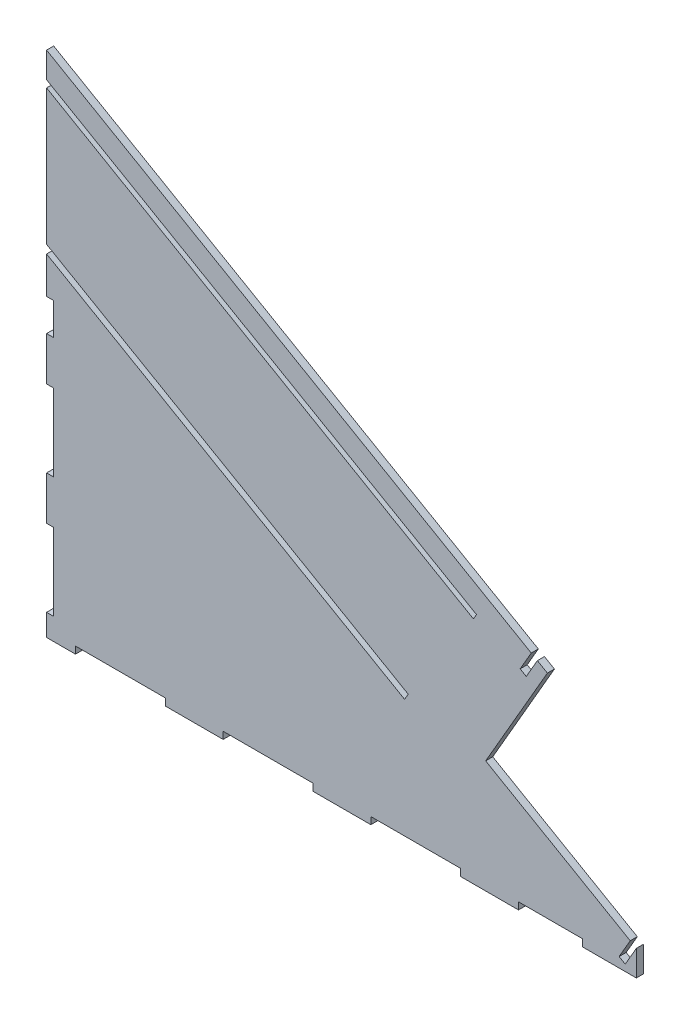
ISO-10303-21;
HEADER;
FILE_DESCRIPTION(('STEP AP214'),'2;1');
FILE_NAME('part.step','',(''),(''),'','','');
FILE_SCHEMA(('AUTOMOTIVE_DESIGN { 1 0 10303 214 1 1 1 1 }'));
ENDSEC;
DATA;
#1=APPLICATION_CONTEXT('core data for automotive mechanical design processes');
#2=APPLICATION_PROTOCOL_DEFINITION('international standard','automotive_design',2000,#1);
#3=PRODUCT_CONTEXT('',#1,'mechanical');
#4=PRODUCT('Part','Part','',(#3));
#5=PRODUCT_RELATED_PRODUCT_CATEGORY('part','',(#4));
#6=PRODUCT_DEFINITION_FORMATION('','',#4);
#7=PRODUCT_DEFINITION_CONTEXT('part definition',#1,'design');
#8=PRODUCT_DEFINITION('design','',#6,#7);
#9=PRODUCT_DEFINITION_SHAPE('','',#8);
#10=(LENGTH_UNIT() NAMED_UNIT(*) SI_UNIT(.MILLI.,.METRE.));
#11=(NAMED_UNIT(*) PLANE_ANGLE_UNIT() SI_UNIT($,.RADIAN.));
#12=(NAMED_UNIT(*) SI_UNIT($,.STERADIAN.) SOLID_ANGLE_UNIT());
#13=UNCERTAINTY_MEASURE_WITH_UNIT(LENGTH_MEASURE(1.E-05),#10,'distance_accuracy_value','');
#14=(GEOMETRIC_REPRESENTATION_CONTEXT(3) GLOBAL_UNCERTAINTY_ASSIGNED_CONTEXT((#13)) GLOBAL_UNIT_ASSIGNED_CONTEXT((#10,
#11,#12)) REPRESENTATION_CONTEXT('',''));
#15=CARTESIAN_POINT('',(0.,0.,0.));
#16=DIRECTION('',(0.,0.,1.));
#17=DIRECTION('',(1.,0.,0.));
#18=AXIS2_PLACEMENT_3D('',#15,#16,#17);
#19=CARTESIAN_POINT('',(390.,241.829885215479,5.5));
#20=DIRECTION('',(-0.86602202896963,0.500005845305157,0.));
#21=DIRECTION('',(-0.500005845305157,-0.86602202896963,0.));
#22=AXIS2_PLACEMENT_3D('',#19,#20,#21);
#23=PLANE('',#22);
#24=DIRECTION('',(0.500005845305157,0.86602202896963,0.));
#25=VECTOR('',#24,1.);
#26=CARTESIAN_POINT('',(390.,241.829885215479,0.));
#27=LINE('',#26,#25);
#28=CARTESIAN_POINT('',(341.935215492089,158.580534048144,0.));
#29=VERTEX_POINT('',#28);
#30=CARTESIAN_POINT('',(390.,241.829885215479,0.));
#31=VERTEX_POINT('',#30);
#32=EDGE_CURVE('E384',#29,#31,#27,.T.);
#33=ORIENTED_EDGE('',*,*,#32,.T.);
#34=DIRECTION('',(0.,0.,-1.));
#35=VECTOR('',#34,1.);
#36=CARTESIAN_POINT('',(390.,241.829885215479,5.5));
#37=LINE('',#36,#35);
#38=CARTESIAN_POINT('',(390.,241.829885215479,5.5));
#39=VERTEX_POINT('',#38);
#40=EDGE_CURVE('E11',#39,#31,#37,.T.);
#41=ORIENTED_EDGE('',*,*,#40,.F.);
#42=DIRECTION('',(0.500005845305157,0.86602202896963,0.));
#43=VECTOR('',#42,1.);
#44=CARTESIAN_POINT('',(390.,241.829885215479,5.5));
#45=LINE('',#44,#43);
#46=CARTESIAN_POINT('',(341.935215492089,158.580534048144,5.5));
#47=VERTEX_POINT('',#46);
#48=EDGE_CURVE('E485',#47,#39,#45,.T.);
#49=ORIENTED_EDGE('',*,*,#48,.F.);
#50=DIRECTION('',(0.,0.,-1.));
#51=VECTOR('',#50,1.);
#52=CARTESIAN_POINT('',(341.935215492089,158.580534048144,5.5));
#53=LINE('',#52,#51);
#54=EDGE_CURVE('E380',#47,#29,#53,.T.);
#55=ORIENTED_EDGE('',*,*,#54,.T.);
#56=EDGE_LOOP('',(#33,#41,#49,#55));
#57=FACE_BOUND('',#56,.T.);
#58=ADVANCED_FACE('F41',(#57),#23,.F.);
#59=CARTESIAN_POINT('',(382.205789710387,246.329944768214,5.5));
#60=DIRECTION('',(-0.500005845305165,-0.866022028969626,0.));
#61=DIRECTION('',(0.866022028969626,-0.500005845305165,0.));
#62=AXIS2_PLACEMENT_3D('',#59,#60,#61);
#63=PLANE('',#62);
#64=DIRECTION('',(-0.866022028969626,0.500005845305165,0.));
#65=VECTOR('',#64,1.);
#66=CARTESIAN_POINT('',(382.205789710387,246.329944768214,0.));
#67=LINE('',#66,#65);
#68=CARTESIAN_POINT('',(382.205789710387,246.329944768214,0.));
#69=VERTEX_POINT('',#68);
#70=EDGE_CURVE('E387',#31,#69,#67,.T.);
#71=ORIENTED_EDGE('',*,*,#70,.T.);
#72=DIRECTION('',(0.,0.,-1.));
#73=VECTOR('',#72,1.);
#74=CARTESIAN_POINT('',(382.205789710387,246.329944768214,5.5));
#75=LINE('',#74,#73);
#76=CARTESIAN_POINT('',(382.205789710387,246.329944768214,5.5));
#77=VERTEX_POINT('',#76);
#78=EDGE_CURVE('E49',#77,#69,#75,.T.);
#79=ORIENTED_EDGE('',*,*,#78,.F.);
#80=DIRECTION('',(-0.866022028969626,0.500005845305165,0.));
#81=VECTOR('',#80,1.);
#82=CARTESIAN_POINT('',(382.205789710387,246.329944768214,5.5));
#83=LINE('',#82,#81);
#84=EDGE_CURVE('E221',#39,#77,#83,.T.);
#85=ORIENTED_EDGE('',*,*,#84,.F.);
#86=ORIENTED_EDGE('',*,*,#40,.T.);
#87=EDGE_LOOP('',(#71,#79,#85,#86));
#88=FACE_BOUND('',#87,.T.);
#89=ADVANCED_FACE('F738',(#88),#63,.F.);
#90=CARTESIAN_POINT('',(373.54546817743,231.330061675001,5.5));
#91=DIRECTION('',(0.866022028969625,-0.500005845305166,0.));
#92=DIRECTION('',(0.500005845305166,0.866022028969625,0.));
#93=AXIS2_PLACEMENT_3D('',#90,#91,#92);
#94=PLANE('',#93);
#95=DIRECTION('',(-0.500005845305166,-0.866022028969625,0.));
#96=VECTOR('',#95,1.);
#97=CARTESIAN_POINT('',(373.54546817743,231.330061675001,0.));
#98=LINE('',#97,#96);
#99=CARTESIAN_POINT('',(373.54546817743,231.330061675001,0.));
#100=VERTEX_POINT('',#99);
#101=EDGE_CURVE('E389',#69,#100,#98,.T.);
#102=ORIENTED_EDGE('',*,*,#101,.T.);
#103=DIRECTION('',(0.,0.,-1.));
#104=VECTOR('',#103,1.);
#105=CARTESIAN_POINT('',(373.54546817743,231.330061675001,5.5));
#106=LINE('',#105,#104);
#107=CARTESIAN_POINT('',(373.54546817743,231.330061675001,5.5));
#108=VERTEX_POINT('',#107);
#109=EDGE_CURVE('E615',#108,#100,#106,.T.);
#110=ORIENTED_EDGE('',*,*,#109,.F.);
#111=DIRECTION('',(-0.500005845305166,-0.866022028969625,0.));
#112=VECTOR('',#111,1.);
#113=CARTESIAN_POINT('',(373.54546817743,231.330061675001,5.5));
#114=LINE('',#113,#112);
#115=EDGE_CURVE('E623',#77,#108,#114,.T.);
#116=ORIENTED_EDGE('',*,*,#115,.F.);
#117=ORIENTED_EDGE('',*,*,#78,.T.);
#118=EDGE_LOOP('',(#102,#110,#116,#117));
#119=FACE_BOUND('',#118,.T.);
#120=ADVANCED_FACE('F621',(#119),#94,.F.);
#121=CARTESIAN_POINT('',(368.782347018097,234.080093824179,5.5));
#122=DIRECTION('',(-0.500005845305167,-0.866022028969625,0.));
#123=DIRECTION('',(0.866022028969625,-0.500005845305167,0.));
#124=AXIS2_PLACEMENT_3D('',#121,#122,#123);
#125=PLANE('',#124);
#126=DIRECTION('',(-0.866022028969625,0.500005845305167,0.));
#127=VECTOR('',#126,1.);
#128=CARTESIAN_POINT('',(368.782347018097,234.080093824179,0.));
#129=LINE('',#128,#127);
#130=CARTESIAN_POINT('',(368.782347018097,234.080093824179,0.));
#131=VERTEX_POINT('',#130);
#132=EDGE_CURVE('E391',#100,#131,#129,.T.);
#133=ORIENTED_EDGE('',*,*,#132,.T.);
#134=DIRECTION('',(0.,0.,-1.));
#135=VECTOR('',#134,1.);
#136=CARTESIAN_POINT('',(368.782347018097,234.080093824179,5.5));
#137=LINE('',#136,#135);
#138=CARTESIAN_POINT('',(368.782347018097,234.080093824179,5.5));
#139=VERTEX_POINT('',#138);
#140=EDGE_CURVE('E612',#139,#131,#137,.T.);
#141=ORIENTED_EDGE('',*,*,#140,.F.);
#142=DIRECTION('',(-0.866022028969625,0.500005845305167,0.));
#143=VECTOR('',#142,1.);
#144=CARTESIAN_POINT('',(368.782347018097,234.080093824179,5.5));
#145=LINE('',#144,#143);
#146=EDGE_CURVE('E639',#108,#139,#145,.T.);
#147=ORIENTED_EDGE('',*,*,#146,.F.);
#148=ORIENTED_EDGE('',*,*,#109,.T.);
#149=EDGE_LOOP('',(#133,#141,#147,#148));
#150=FACE_BOUND('',#149,.T.);
#151=ADVANCED_FACE('F630',(#150),#125,.F.);
#152=CARTESIAN_POINT('',(377.442668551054,249.079976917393,5.5));
#153=DIRECTION('',(-0.866022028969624,0.500005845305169,0.));
#154=DIRECTION('',(-0.500005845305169,-0.866022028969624,0.));
#155=AXIS2_PLACEMENT_3D('',#152,#153,#154);
#156=PLANE('',#155);
#157=DIRECTION('',(0.500005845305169,0.866022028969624,0.));
#158=VECTOR('',#157,1.);
#159=CARTESIAN_POINT('',(377.442668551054,249.079976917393,0.));
#160=LINE('',#159,#158);
#161=CARTESIAN_POINT('',(377.442668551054,249.079976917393,0.));
#162=VERTEX_POINT('',#161);
#163=EDGE_CURVE('E393',#131,#162,#160,.T.);
#164=ORIENTED_EDGE('',*,*,#163,.T.);
#165=DIRECTION('',(0.,0.,-1.));
#166=VECTOR('',#165,1.);
#167=CARTESIAN_POINT('',(377.442668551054,249.079976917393,5.5));
#168=LINE('',#167,#166);
#169=CARTESIAN_POINT('',(377.442668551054,249.079976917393,5.5));
#170=VERTEX_POINT('',#169);
#171=EDGE_CURVE('E609',#170,#162,#168,.T.);
#172=ORIENTED_EDGE('',*,*,#171,.F.);
#173=DIRECTION('',(0.500005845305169,0.866022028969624,0.));
#174=VECTOR('',#173,1.);
#175=CARTESIAN_POINT('',(377.442668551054,249.079976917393,5.5));
#176=LINE('',#175,#174);
#177=EDGE_CURVE('E636',#139,#170,#176,.T.);
#178=ORIENTED_EDGE('',*,*,#177,.F.);
#179=ORIENTED_EDGE('',*,*,#140,.T.);
#180=EDGE_LOOP('',(#164,#172,#178,#179));
#181=FACE_BOUND('',#180,.T.);
#182=ADVANCED_FACE('F634',(#181),#156,.F.);
#183=CARTESIAN_POINT('',(0.,467.,5.5));
#184=DIRECTION('',(-0.500005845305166,-0.866022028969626,0.));
#185=DIRECTION('',(0.866022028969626,-0.500005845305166,0.));
#186=AXIS2_PLACEMENT_3D('',#183,#184,#185);
#187=PLANE('',#186);
#188=DIRECTION('',(-0.866022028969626,0.500005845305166,0.));
#189=VECTOR('',#188,1.);
#190=CARTESIAN_POINT('',(0.,467.,0.));
#191=LINE('',#190,#189);
#192=CARTESIAN_POINT('',(0.,467.,0.));
#193=VERTEX_POINT('',#192);
#194=EDGE_CURVE('E395',#162,#193,#191,.T.);
#195=ORIENTED_EDGE('',*,*,#194,.T.);
#196=DIRECTION('',(0.,0.,-1.));
#197=VECTOR('',#196,1.);
#198=CARTESIAN_POINT('',(0.,467.,5.5));
#199=LINE('',#198,#197);
#200=CARTESIAN_POINT('',(0.,467.,5.5));
#201=VERTEX_POINT('',#200);
#202=EDGE_CURVE('E606',#201,#193,#199,.T.);
#203=ORIENTED_EDGE('',*,*,#202,.F.);
#204=DIRECTION('',(-0.866022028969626,0.500005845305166,0.));
#205=VECTOR('',#204,1.);
#206=CARTESIAN_POINT('',(0.,467.,5.5));
#207=LINE('',#206,#205);
#208=EDGE_CURVE('E638',#170,#201,#207,.T.);
#209=ORIENTED_EDGE('',*,*,#208,.F.);
#210=ORIENTED_EDGE('',*,*,#171,.T.);
#211=EDGE_LOOP('',(#195,#203,#209,#210));
#212=FACE_BOUND('',#211,.T.);
#213=ADVANCED_FACE('F750',(#212),#187,.F.);
#214=CARTESIAN_POINT('',(0.,447.,5.5));
#215=DIRECTION('',(1.,0.,0.));
#216=DIRECTION('',(0.,0.,-1.));
#217=AXIS2_PLACEMENT_3D('',#214,#215,#216);
#218=PLANE('',#217);
#219=DIRECTION('',(0.,-1.,0.));
#220=VECTOR('',#219,1.);
#221=CARTESIAN_POINT('',(0.,447.,0.));
#222=LINE('',#221,#220);
#223=CARTESIAN_POINT('',(0.,447.,0.));
#224=VERTEX_POINT('',#223);
#225=EDGE_CURVE('E397',#193,#224,#222,.T.);
#226=ORIENTED_EDGE('',*,*,#225,.T.);
#227=DIRECTION('',(0.,0.,-1.));
#228=VECTOR('',#227,1.);
#229=CARTESIAN_POINT('',(0.,447.,5.5));
#230=LINE('',#229,#228);
#231=CARTESIAN_POINT('',(0.,447.,5.5));
#232=VERTEX_POINT('',#231);
#233=EDGE_CURVE('E603',#232,#224,#230,.T.);
#234=ORIENTED_EDGE('',*,*,#233,.F.);
#235=DIRECTION('',(0.,-1.,0.));
#236=VECTOR('',#235,1.);
#237=CARTESIAN_POINT('',(0.,447.,5.5));
#238=LINE('',#237,#236);
#239=EDGE_CURVE('E641',#201,#232,#238,.T.);
#240=ORIENTED_EDGE('',*,*,#239,.F.);
#241=ORIENTED_EDGE('',*,*,#202,.T.);
#242=EDGE_LOOP('',(#226,#234,#240,#241));
#243=FACE_BOUND('',#242,.T.);
#244=ADVANCED_FACE('F753',(#243),#218,.F.);
#245=CARTESIAN_POINT('',(334.794972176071,253.703019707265,5.5));
#246=DIRECTION('',(0.500005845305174,0.866022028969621,0.));
#247=DIRECTION('',(-0.866022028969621,0.500005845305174,0.));
#248=AXIS2_PLACEMENT_3D('',#245,#246,#247);
#249=PLANE('',#248);
#250=DIRECTION('',(0.86602202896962,-0.500005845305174,0.));
#251=VECTOR('',#250,1.);
#252=CARTESIAN_POINT('',(334.794972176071,253.703019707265,0.));
#253=LINE('',#252,#251);
#254=CARTESIAN_POINT('',(334.794972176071,253.703019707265,0.));
#255=VERTEX_POINT('',#254);
#256=EDGE_CURVE('E400',#224,#255,#253,.T.);
#257=ORIENTED_EDGE('',*,*,#256,.T.);
#258=DIRECTION('',(0.,0.,-1.));
#259=VECTOR('',#258,1.);
#260=CARTESIAN_POINT('',(334.794972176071,253.703019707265,5.5));
#261=LINE('',#260,#259);
#262=CARTESIAN_POINT('',(334.794972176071,253.703019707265,5.5));
#263=VERTEX_POINT('',#262);
#264=EDGE_CURVE('E600',#263,#255,#261,.T.);
#265=ORIENTED_EDGE('',*,*,#264,.F.);
#266=DIRECTION('',(0.866022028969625,-0.500005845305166,0.));
#267=VECTOR('',#266,1.);
#268=CARTESIAN_POINT('',(0.,447.,5.5));
#269=LINE('',#268,#267);
#270=EDGE_CURVE('E647',#232,#263,#269,.T.);
#271=ORIENTED_EDGE('',*,*,#270,.F.);
#272=ORIENTED_EDGE('',*,*,#233,.T.);
#273=EDGE_LOOP('',(#257,#265,#271,#272));
#274=FACE_BOUND('',#273,.T.);
#275=ADVANCED_FACE('F757',(#274),#249,.F.);
#276=CARTESIAN_POINT('',(332.413383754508,249.578051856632,5.5));
#277=DIRECTION('',(0.866022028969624,-0.500005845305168,0.));
#278=DIRECTION('',(0.500005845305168,0.866022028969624,0.));
#279=AXIS2_PLACEMENT_3D('',#276,#277,#278);
#280=PLANE('',#279);
#281=DIRECTION('',(-0.500005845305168,-0.866022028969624,0.));
#282=VECTOR('',#281,1.);
#283=CARTESIAN_POINT('',(332.413383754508,249.578051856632,0.));
#284=LINE('',#283,#282);
#285=CARTESIAN_POINT('',(332.413383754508,249.578051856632,0.));
#286=VERTEX_POINT('',#285);
#287=EDGE_CURVE('E402',#255,#286,#284,.T.);
#288=ORIENTED_EDGE('',*,*,#287,.T.);
#289=DIRECTION('',(0.,0.,-1.));
#290=VECTOR('',#289,1.);
#291=CARTESIAN_POINT('',(332.413383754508,249.578051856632,5.5));
#292=LINE('',#291,#290);
#293=CARTESIAN_POINT('',(332.413383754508,249.578051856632,5.5));
#294=VERTEX_POINT('',#293);
#295=EDGE_CURVE('E597',#294,#286,#292,.T.);
#296=ORIENTED_EDGE('',*,*,#295,.F.);
#297=DIRECTION('',(-0.500005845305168,-0.866022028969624,0.));
#298=VECTOR('',#297,1.);
#299=CARTESIAN_POINT('',(332.413383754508,249.578051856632,5.5));
#300=LINE('',#299,#298);
#301=EDGE_CURVE('E649',#263,#294,#300,.T.);
#302=ORIENTED_EDGE('',*,*,#301,.F.);
#303=ORIENTED_EDGE('',*,*,#264,.T.);
#304=EDGE_LOOP('',(#288,#296,#302,#303));
#305=FACE_BOUND('',#304,.T.);
#306=ADVANCED_FACE('F761',(#305),#280,.F.);
#307=CARTESIAN_POINT('',(332.413383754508,249.578051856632,5.5));
#308=DIRECTION('',(-0.500005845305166,-0.866022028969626,0.));
#309=DIRECTION('',(0.866022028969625,-0.500005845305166,0.));
#310=AXIS2_PLACEMENT_3D('',#307,#308,#309);
#311=PLANE('',#310);
#312=DIRECTION('',(-0.866022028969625,0.500005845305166,0.));
#313=VECTOR('',#312,1.);
#314=CARTESIAN_POINT('',(332.413383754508,249.578051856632,0.));
#315=LINE('',#314,#313);
#316=CARTESIAN_POINT('',(0.,441.5,0.));
#317=VERTEX_POINT('',#316);
#318=EDGE_CURVE('E404',#286,#317,#315,.T.);
#319=ORIENTED_EDGE('',*,*,#318,.T.);
#320=DIRECTION('',(0.,0.,-1.));
#321=VECTOR('',#320,1.);
#322=CARTESIAN_POINT('',(0.,441.5,5.5));
#323=LINE('',#322,#321);
#324=CARTESIAN_POINT('',(0.,441.5,5.5));
#325=VERTEX_POINT('',#324);
#326=EDGE_CURVE('E594',#325,#317,#323,.T.);
#327=ORIENTED_EDGE('',*,*,#326,.F.);
#328=DIRECTION('',(-0.866022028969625,0.500005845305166,0.));
#329=VECTOR('',#328,1.);
#330=CARTESIAN_POINT('',(332.413383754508,249.578051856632,5.5));
#331=LINE('',#330,#329);
#332=EDGE_CURVE('E651',#294,#325,#331,.T.);
#333=ORIENTED_EDGE('',*,*,#332,.F.);
#334=ORIENTED_EDGE('',*,*,#295,.T.);
#335=EDGE_LOOP('',(#319,#327,#333,#334));
#336=FACE_BOUND('',#335,.T.);
#337=ADVANCED_FACE('F765',(#336),#311,.F.);
#338=CARTESIAN_POINT('',(0.,361.5,5.5));
#339=DIRECTION('',(1.,0.,0.));
#340=DIRECTION('',(0.,1.,0.));
#341=AXIS2_PLACEMENT_3D('',#338,#339,#340);
#342=PLANE('',#341);
#343=DIRECTION('',(0.,-1.,0.));
#344=VECTOR('',#343,1.);
#345=CARTESIAN_POINT('',(0.,361.5,0.));
#346=LINE('',#345,#344);
#347=CARTESIAN_POINT('',(0.,336.,0.));
#348=VERTEX_POINT('',#347);
#349=EDGE_CURVE('E407',#317,#348,#346,.T.);
#350=ORIENTED_EDGE('',*,*,#349,.T.);
#351=DIRECTION('',(0.,0.,-1.));
#352=VECTOR('',#351,1.);
#353=CARTESIAN_POINT('',(0.,336.,5.5));
#354=LINE('',#353,#352);
#355=CARTESIAN_POINT('',(0.,336.,5.5));
#356=VERTEX_POINT('',#355);
#357=EDGE_CURVE('E591',#356,#348,#354,.T.);
#358=ORIENTED_EDGE('',*,*,#357,.F.);
#359=DIRECTION('',(0.,-1.,0.));
#360=VECTOR('',#359,1.);
#361=CARTESIAN_POINT('',(0.,421.5,5.5));
#362=LINE('',#361,#360);
#363=EDGE_CURVE('E653',#325,#356,#362,.T.);
#364=ORIENTED_EDGE('',*,*,#363,.F.);
#365=ORIENTED_EDGE('',*,*,#326,.T.);
#366=EDGE_LOOP('',(#350,#358,#364,#365));
#367=FACE_BOUND('',#366,.T.);
#368=ADVANCED_FACE('F769',(#367),#342,.F.);
#369=CARTESIAN_POINT('',(281.618684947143,173.404842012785,5.5));
#370=DIRECTION('',(0.500005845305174,0.866022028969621,0.));
#371=DIRECTION('',(-0.866022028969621,0.500005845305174,0.));
#372=AXIS2_PLACEMENT_3D('',#369,#370,#371);
#373=PLANE('',#372);
#374=DIRECTION('',(0.866022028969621,-0.500005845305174,0.));
#375=VECTOR('',#374,1.);
#376=CARTESIAN_POINT('',(281.618684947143,173.404842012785,0.));
#377=LINE('',#376,#375);
#378=CARTESIAN_POINT('',(281.618684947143,173.404842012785,0.));
#379=VERTEX_POINT('',#378);
#380=EDGE_CURVE('E410',#348,#379,#377,.T.);
#381=ORIENTED_EDGE('',*,*,#380,.T.);
#382=DIRECTION('',(0.,0.,-1.));
#383=VECTOR('',#382,1.);
#384=CARTESIAN_POINT('',(281.618684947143,173.404842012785,5.5));
#385=LINE('',#384,#383);
#386=CARTESIAN_POINT('',(281.618684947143,173.404842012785,5.5));
#387=VERTEX_POINT('',#386);
#388=EDGE_CURVE('E588',#387,#379,#385,.T.);
#389=ORIENTED_EDGE('',*,*,#388,.F.);
#390=DIRECTION('',(0.866022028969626,-0.500005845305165,0.));
#391=VECTOR('',#390,1.);
#392=CARTESIAN_POINT('',(0.,336.,5.5));
#393=LINE('',#392,#391);
#394=EDGE_CURVE('E655',#356,#387,#393,.T.);
#395=ORIENTED_EDGE('',*,*,#394,.F.);
#396=ORIENTED_EDGE('',*,*,#357,.T.);
#397=EDGE_LOOP('',(#381,#389,#395,#396));
#398=FACE_BOUND('',#397,.T.);
#399=ADVANCED_FACE('F773',(#398),#373,.F.);
#400=CARTESIAN_POINT('',(278.804080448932,168.529880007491,5.5));
#401=DIRECTION('',(0.866022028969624,-0.500005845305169,0.));
#402=DIRECTION('',(0.500005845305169,0.866022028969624,0.));
#403=AXIS2_PLACEMENT_3D('',#400,#401,#402);
#404=PLANE('',#403);
#405=DIRECTION('',(-0.500005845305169,-0.866022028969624,0.));
#406=VECTOR('',#405,1.);
#407=CARTESIAN_POINT('',(278.804080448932,168.529880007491,0.));
#408=LINE('',#407,#406);
#409=CARTESIAN_POINT('',(278.804080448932,168.529880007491,0.));
#410=VERTEX_POINT('',#409);
#411=EDGE_CURVE('E412',#379,#410,#408,.T.);
#412=ORIENTED_EDGE('',*,*,#411,.T.);
#413=DIRECTION('',(0.,0.,-1.));
#414=VECTOR('',#413,1.);
#415=CARTESIAN_POINT('',(278.804080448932,168.529880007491,5.5));
#416=LINE('',#415,#414);
#417=CARTESIAN_POINT('',(278.804080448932,168.529880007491,5.5));
#418=VERTEX_POINT('',#417);
#419=EDGE_CURVE('E585',#418,#410,#416,.T.);
#420=ORIENTED_EDGE('',*,*,#419,.F.);
#421=DIRECTION('',(-0.500005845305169,-0.866022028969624,0.));
#422=VECTOR('',#421,1.);
#423=CARTESIAN_POINT('',(278.804080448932,168.529880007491,5.5));
#424=LINE('',#423,#422);
#425=EDGE_CURVE('E657',#387,#418,#424,.T.);
#426=ORIENTED_EDGE('',*,*,#425,.F.);
#427=ORIENTED_EDGE('',*,*,#388,.T.);
#428=EDGE_LOOP('',(#412,#420,#426,#427));
#429=FACE_BOUND('',#428,.T.);
#430=ADVANCED_FACE('F777',(#429),#404,.F.);
#431=CARTESIAN_POINT('',(-2.21220795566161E-13,329.5,5.5));
#432=DIRECTION('',(-0.500005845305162,-0.866022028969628,0.));
#433=DIRECTION('',(0.866022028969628,-0.500005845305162,0.));
#434=AXIS2_PLACEMENT_3D('',#431,#432,#433);
#435=PLANE('',#434);
#436=DIRECTION('',(-0.866022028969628,0.500005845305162,0.));
#437=VECTOR('',#436,1.);
#438=CARTESIAN_POINT('',(-2.21220795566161E-13,329.5,0.));
#439=LINE('',#438,#437);
#440=CARTESIAN_POINT('',(-2.21220795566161E-13,329.5,0.));
#441=VERTEX_POINT('',#440);
#442=EDGE_CURVE('E414',#410,#441,#439,.T.);
#443=ORIENTED_EDGE('',*,*,#442,.T.);
#444=DIRECTION('',(0.,0.,-1.));
#445=VECTOR('',#444,1.);
#446=CARTESIAN_POINT('',(-2.21220795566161E-13,329.5,5.5));
#447=LINE('',#446,#445);
#448=CARTESIAN_POINT('',(-2.21220795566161E-13,329.5,5.5));
#449=VERTEX_POINT('',#448);
#450=EDGE_CURVE('E582',#449,#441,#447,.T.);
#451=ORIENTED_EDGE('',*,*,#450,.F.);
#452=DIRECTION('',(-0.866022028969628,0.500005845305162,0.));
#453=VECTOR('',#452,1.);
#454=CARTESIAN_POINT('',(-2.21220795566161E-13,329.5,5.5));
#455=LINE('',#454,#453);
#456=EDGE_CURVE('E659',#418,#449,#455,.T.);
#457=ORIENTED_EDGE('',*,*,#456,.F.);
#458=ORIENTED_EDGE('',*,*,#419,.T.);
#459=EDGE_LOOP('',(#443,#451,#457,#458));
#460=FACE_BOUND('',#459,.T.);
#461=ADVANCED_FACE('F781',(#460),#435,.F.);
#462=CARTESIAN_POINT('',(-2.21220795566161E-13,329.5,5.5));
#463=DIRECTION('',(1.,0.,0.));
#464=DIRECTION('',(0.,1.,0.));
#465=AXIS2_PLACEMENT_3D('',#462,#463,#464);
#466=PLANE('',#465);
#467=DIRECTION('',(0.,-1.,0.));
#468=VECTOR('',#467,1.);
#469=CARTESIAN_POINT('',(-2.21220795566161E-13,329.5,0.));
#470=LINE('',#469,#468);
#471=CARTESIAN_POINT('',(0.,300.829417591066,0.));
#472=VERTEX_POINT('',#471);
#473=EDGE_CURVE('E416',#441,#472,#470,.T.);
#474=ORIENTED_EDGE('',*,*,#473,.T.);
#475=DIRECTION('',(0.,0.,-1.));
#476=VECTOR('',#475,1.);
#477=CARTESIAN_POINT('',(0.,300.829417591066,5.5));
#478=LINE('',#477,#476);
#479=CARTESIAN_POINT('',(0.,300.829417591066,5.5));
#480=VERTEX_POINT('',#479);
#481=EDGE_CURVE('E579',#480,#472,#478,.T.);
#482=ORIENTED_EDGE('',*,*,#481,.F.);
#483=DIRECTION('',(0.,-1.,0.));
#484=VECTOR('',#483,1.);
#485=CARTESIAN_POINT('',(-2.21220795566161E-13,329.5,5.5));
#486=LINE('',#485,#484);
#487=EDGE_CURVE('E661',#449,#480,#486,.T.);
#488=ORIENTED_EDGE('',*,*,#487,.F.);
#489=ORIENTED_EDGE('',*,*,#450,.T.);
#490=EDGE_LOOP('',(#474,#482,#488,#489));
#491=FACE_BOUND('',#490,.T.);
#492=ADVANCED_FACE('F785',(#491),#466,.F.);
#493=CARTESIAN_POINT('',(5.5,300.829417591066,5.5));
#494=DIRECTION('',(0.,1.,0.));
#495=DIRECTION('',(0.,0.,1.));
#496=AXIS2_PLACEMENT_3D('',#493,#494,#495);
#497=PLANE('',#496);
#498=DIRECTION('',(1.,0.,0.));
#499=VECTOR('',#498,1.);
#500=CARTESIAN_POINT('',(5.5,300.829417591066,0.));
#501=LINE('',#500,#499);
#502=CARTESIAN_POINT('',(5.5,300.829417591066,0.));
#503=VERTEX_POINT('',#502);
#504=EDGE_CURVE('E418',#472,#503,#501,.T.);
#505=ORIENTED_EDGE('',*,*,#504,.T.);
#506=DIRECTION('',(0.,0.,-1.));
#507=VECTOR('',#506,1.);
#508=CARTESIAN_POINT('',(5.5,300.829417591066,5.5));
#509=LINE('',#508,#507);
#510=CARTESIAN_POINT('',(5.5,300.829417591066,5.5));
#511=VERTEX_POINT('',#510);
#512=EDGE_CURVE('E576',#511,#503,#509,.T.);
#513=ORIENTED_EDGE('',*,*,#512,.F.);
#514=DIRECTION('',(1.,0.,0.));
#515=VECTOR('',#514,1.);
#516=CARTESIAN_POINT('',(5.5,300.829417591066,5.5));
#517=LINE('',#516,#515);
#518=EDGE_CURVE('E663',#480,#511,#517,.T.);
#519=ORIENTED_EDGE('',*,*,#518,.F.);
#520=ORIENTED_EDGE('',*,*,#481,.T.);
#521=EDGE_LOOP('',(#505,#513,#519,#520));
#522=FACE_BOUND('',#521,.T.);
#523=ADVANCED_FACE('F789',(#522),#497,.F.);
#524=CARTESIAN_POINT('',(5.5,275.829417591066,5.5));
#525=DIRECTION('',(1.,0.,0.));
#526=DIRECTION('',(0.,0.,-1.));
#527=AXIS2_PLACEMENT_3D('',#524,#525,#526);
#528=PLANE('',#527);
#529=DIRECTION('',(0.,-1.,0.));
#530=VECTOR('',#529,1.);
#531=CARTESIAN_POINT('',(5.5,275.829417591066,0.));
#532=LINE('',#531,#530);
#533=CARTESIAN_POINT('',(5.5,275.829417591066,0.));
#534=VERTEX_POINT('',#533);
#535=EDGE_CURVE('E420',#503,#534,#532,.T.);
#536=ORIENTED_EDGE('',*,*,#535,.T.);
#537=DIRECTION('',(0.,0.,-1.));
#538=VECTOR('',#537,1.);
#539=CARTESIAN_POINT('',(5.5,275.829417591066,5.5));
#540=LINE('',#539,#538);
#541=CARTESIAN_POINT('',(5.5,275.829417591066,5.5));
#542=VERTEX_POINT('',#541);
#543=EDGE_CURVE('E573',#542,#534,#540,.T.);
#544=ORIENTED_EDGE('',*,*,#543,.F.);
#545=DIRECTION('',(0.,-1.,0.));
#546=VECTOR('',#545,1.);
#547=CARTESIAN_POINT('',(5.5,275.829417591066,5.5));
#548=LINE('',#547,#546);
#549=EDGE_CURVE('E665',#511,#542,#548,.T.);
#550=ORIENTED_EDGE('',*,*,#549,.F.);
#551=ORIENTED_EDGE('',*,*,#512,.T.);
#552=EDGE_LOOP('',(#536,#544,#550,#551));
#553=FACE_BOUND('',#552,.T.);
#554=ADVANCED_FACE('F793',(#553),#528,.F.);
#555=CARTESIAN_POINT('',(5.5,275.829417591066,5.5));
#556=DIRECTION('',(0.,-1.,0.));
#557=DIRECTION('',(0.,0.,-1.));
#558=AXIS2_PLACEMENT_3D('',#555,#556,#557);
#559=PLANE('',#558);
#560=DIRECTION('',(-1.,0.,0.));
#561=VECTOR('',#560,1.);
#562=CARTESIAN_POINT('',(5.5,275.829417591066,0.));
#563=LINE('',#562,#561);
#564=CARTESIAN_POINT('',(0.,275.829417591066,0.));
#565=VERTEX_POINT('',#564);
#566=EDGE_CURVE('E422',#534,#565,#563,.T.);
#567=ORIENTED_EDGE('',*,*,#566,.T.);
#568=DIRECTION('',(0.,0.,-1.));
#569=VECTOR('',#568,1.);
#570=CARTESIAN_POINT('',(0.,275.829417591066,5.5));
#571=LINE('',#570,#569);
#572=CARTESIAN_POINT('',(0.,275.829417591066,5.5));
#573=VERTEX_POINT('',#572);
#574=EDGE_CURVE('E570',#573,#565,#571,.T.);
#575=ORIENTED_EDGE('',*,*,#574,.F.);
#576=DIRECTION('',(-1.,0.,0.));
#577=VECTOR('',#576,1.);
#578=CARTESIAN_POINT('',(5.5,275.829417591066,5.5));
#579=LINE('',#578,#577);
#580=EDGE_CURVE('E667',#542,#573,#579,.T.);
#581=ORIENTED_EDGE('',*,*,#580,.F.);
#582=ORIENTED_EDGE('',*,*,#543,.T.);
#583=EDGE_LOOP('',(#567,#575,#581,#582));
#584=FACE_BOUND('',#583,.T.);
#585=ADVANCED_FACE('F797',(#584),#559,.F.);
#586=CARTESIAN_POINT('',(0.,275.829417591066,5.5));
#587=DIRECTION('',(1.,0.,0.));
#588=DIRECTION('',(0.,1.,0.));
#589=AXIS2_PLACEMENT_3D('',#586,#587,#588);
#590=PLANE('',#589);
#591=DIRECTION('',(0.,-1.,0.));
#592=VECTOR('',#591,1.);
#593=CARTESIAN_POINT('',(0.,275.829417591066,0.));
#594=LINE('',#593,#592);
#595=CARTESIAN_POINT('',(0.,241.829417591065,0.));
#596=VERTEX_POINT('',#595);
#597=EDGE_CURVE('E424',#565,#596,#594,.T.);
#598=ORIENTED_EDGE('',*,*,#597,.T.);
#599=DIRECTION('',(0.,0.,-1.));
#600=VECTOR('',#599,1.);
#601=CARTESIAN_POINT('',(0.,241.829417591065,5.5));
#602=LINE('',#601,#600);
#603=CARTESIAN_POINT('',(0.,241.829417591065,5.5));
#604=VERTEX_POINT('',#603);
#605=EDGE_CURVE('E567',#604,#596,#602,.T.);
#606=ORIENTED_EDGE('',*,*,#605,.F.);
#607=DIRECTION('',(0.,-1.,0.));
#608=VECTOR('',#607,1.);
#609=CARTESIAN_POINT('',(0.,275.829417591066,5.5));
#610=LINE('',#609,#608);
#611=EDGE_CURVE('E669',#573,#604,#610,.T.);
#612=ORIENTED_EDGE('',*,*,#611,.F.);
#613=ORIENTED_EDGE('',*,*,#574,.T.);
#614=EDGE_LOOP('',(#598,#606,#612,#613));
#615=FACE_BOUND('',#614,.T.);
#616=ADVANCED_FACE('F801',(#615),#590,.F.);
#617=CARTESIAN_POINT('',(5.5,241.829417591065,5.5));
#618=DIRECTION('',(0.,1.,0.));
#619=DIRECTION('',(-1.,0.,0.));
#620=AXIS2_PLACEMENT_3D('',#617,#618,#619);
#621=PLANE('',#620);
#622=DIRECTION('',(1.,0.,0.));
#623=VECTOR('',#622,1.);
#624=CARTESIAN_POINT('',(5.5,241.829417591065,0.));
#625=LINE('',#624,#623);
#626=CARTESIAN_POINT('',(5.5,241.829417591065,0.));
#627=VERTEX_POINT('',#626);
#628=EDGE_CURVE('E426',#596,#627,#625,.T.);
#629=ORIENTED_EDGE('',*,*,#628,.T.);
#630=DIRECTION('',(0.,0.,-1.));
#631=VECTOR('',#630,1.);
#632=CARTESIAN_POINT('',(5.5,241.829417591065,5.5));
#633=LINE('',#632,#631);
#634=CARTESIAN_POINT('',(5.5,241.829417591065,5.5));
#635=VERTEX_POINT('',#634);
#636=EDGE_CURVE('E564',#635,#627,#633,.T.);
#637=ORIENTED_EDGE('',*,*,#636,.F.);
#638=DIRECTION('',(1.,0.,0.));
#639=VECTOR('',#638,1.);
#640=CARTESIAN_POINT('',(5.5,241.829417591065,5.5));
#641=LINE('',#640,#639);
#642=EDGE_CURVE('E671',#604,#635,#641,.T.);
#643=ORIENTED_EDGE('',*,*,#642,.F.);
#644=ORIENTED_EDGE('',*,*,#605,.T.);
#645=EDGE_LOOP('',(#629,#637,#643,#644));
#646=FACE_BOUND('',#645,.T.);
#647=ADVANCED_FACE('F805',(#646),#621,.F.);
#648=CARTESIAN_POINT('',(5.5,181.829417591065,5.5));
#649=DIRECTION('',(1.,0.,0.));
#650=DIRECTION('',(0.,0.,-1.));
#651=AXIS2_PLACEMENT_3D('',#648,#649,#650);
#652=PLANE('',#651);
#653=DIRECTION('',(0.,-1.,0.));
#654=VECTOR('',#653,1.);
#655=CARTESIAN_POINT('',(5.5,181.829417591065,0.));
#656=LINE('',#655,#654);
#657=CARTESIAN_POINT('',(5.5,181.829417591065,0.));
#658=VERTEX_POINT('',#657);
#659=EDGE_CURVE('E428',#627,#658,#656,.T.);
#660=ORIENTED_EDGE('',*,*,#659,.T.);
#661=DIRECTION('',(0.,0.,-1.));
#662=VECTOR('',#661,1.);
#663=CARTESIAN_POINT('',(5.5,181.829417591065,5.5));
#664=LINE('',#663,#662);
#665=CARTESIAN_POINT('',(5.5,181.829417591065,5.5));
#666=VERTEX_POINT('',#665);
#667=EDGE_CURVE('E561',#666,#658,#664,.T.);
#668=ORIENTED_EDGE('',*,*,#667,.F.);
#669=DIRECTION('',(0.,-1.,0.));
#670=VECTOR('',#669,1.);
#671=CARTESIAN_POINT('',(5.5,181.829417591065,5.5));
#672=LINE('',#671,#670);
#673=EDGE_CURVE('E673',#635,#666,#672,.T.);
#674=ORIENTED_EDGE('',*,*,#673,.F.);
#675=ORIENTED_EDGE('',*,*,#636,.T.);
#676=EDGE_LOOP('',(#660,#668,#674,#675));
#677=FACE_BOUND('',#676,.T.);
#678=ADVANCED_FACE('F809',(#677),#652,.F.);
#679=CARTESIAN_POINT('',(5.5,181.829417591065,5.5));
#680=DIRECTION('',(0.,-1.,0.));
#681=DIRECTION('',(0.,0.,-1.));
#682=AXIS2_PLACEMENT_3D('',#679,#680,#681);
#683=PLANE('',#682);
#684=DIRECTION('',(-1.,0.,0.));
#685=VECTOR('',#684,1.);
#686=CARTESIAN_POINT('',(5.5,181.829417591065,0.));
#687=LINE('',#686,#685);
#688=CARTESIAN_POINT('',(0.,181.829417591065,0.));
#689=VERTEX_POINT('',#688);
#690=EDGE_CURVE('E430',#658,#689,#687,.T.);
#691=ORIENTED_EDGE('',*,*,#690,.T.);
#692=DIRECTION('',(0.,0.,-1.));
#693=VECTOR('',#692,1.);
#694=CARTESIAN_POINT('',(0.,181.829417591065,5.5));
#695=LINE('',#694,#693);
#696=CARTESIAN_POINT('',(0.,181.829417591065,5.5));
#697=VERTEX_POINT('',#696);
#698=EDGE_CURVE('E558',#697,#689,#695,.T.);
#699=ORIENTED_EDGE('',*,*,#698,.F.);
#700=DIRECTION('',(-1.,0.,0.));
#701=VECTOR('',#700,1.);
#702=CARTESIAN_POINT('',(5.5,181.829417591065,5.5));
#703=LINE('',#702,#701);
#704=EDGE_CURVE('E675',#666,#697,#703,.T.);
#705=ORIENTED_EDGE('',*,*,#704,.F.);
#706=ORIENTED_EDGE('',*,*,#667,.T.);
#707=EDGE_LOOP('',(#691,#699,#705,#706));
#708=FACE_BOUND('',#707,.T.);
#709=ADVANCED_FACE('F813',(#708),#683,.F.);
#710=CARTESIAN_POINT('',(0.,181.829417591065,5.5));
#711=DIRECTION('',(1.,0.,0.));
#712=DIRECTION('',(0.,1.,0.));
#713=AXIS2_PLACEMENT_3D('',#710,#711,#712);
#714=PLANE('',#713);
#715=DIRECTION('',(0.,-1.,0.));
#716=VECTOR('',#715,1.);
#717=CARTESIAN_POINT('',(0.,181.829417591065,0.));
#718=LINE('',#717,#716);
#719=CARTESIAN_POINT('',(0.,147.829417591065,0.));
#720=VERTEX_POINT('',#719);
#721=EDGE_CURVE('E432',#689,#720,#718,.T.);
#722=ORIENTED_EDGE('',*,*,#721,.T.);
#723=DIRECTION('',(0.,0.,-1.));
#724=VECTOR('',#723,1.);
#725=CARTESIAN_POINT('',(0.,147.829417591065,5.5));
#726=LINE('',#725,#724);
#727=CARTESIAN_POINT('',(0.,147.829417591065,5.5));
#728=VERTEX_POINT('',#727);
#729=EDGE_CURVE('E555',#728,#720,#726,.T.);
#730=ORIENTED_EDGE('',*,*,#729,.F.);
#731=DIRECTION('',(0.,-1.,0.));
#732=VECTOR('',#731,1.);
#733=CARTESIAN_POINT('',(0.,181.829417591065,5.5));
#734=LINE('',#733,#732);
#735=EDGE_CURVE('E677',#697,#728,#734,.T.);
#736=ORIENTED_EDGE('',*,*,#735,.F.);
#737=ORIENTED_EDGE('',*,*,#698,.T.);
#738=EDGE_LOOP('',(#722,#730,#736,#737));
#739=FACE_BOUND('',#738,.T.);
#740=ADVANCED_FACE('F817',(#739),#714,.F.);
#741=CARTESIAN_POINT('',(5.5,147.829417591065,5.5));
#742=DIRECTION('',(0.,1.,0.));
#743=DIRECTION('',(0.,0.,1.));
#744=AXIS2_PLACEMENT_3D('',#741,#742,#743);
#745=PLANE('',#744);
#746=DIRECTION('',(1.,0.,0.));
#747=VECTOR('',#746,1.);
#748=CARTESIAN_POINT('',(5.5,147.829417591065,0.));
#749=LINE('',#748,#747);
#750=CARTESIAN_POINT('',(5.5,147.829417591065,0.));
#751=VERTEX_POINT('',#750);
#752=EDGE_CURVE('E434',#720,#751,#749,.T.);
#753=ORIENTED_EDGE('',*,*,#752,.T.);
#754=DIRECTION('',(0.,0.,-1.));
#755=VECTOR('',#754,1.);
#756=CARTESIAN_POINT('',(5.5,147.829417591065,5.5));
#757=LINE('',#756,#755);
#758=CARTESIAN_POINT('',(5.5,147.829417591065,5.5));
#759=VERTEX_POINT('',#758);
#760=EDGE_CURVE('E552',#759,#751,#757,.T.);
#761=ORIENTED_EDGE('',*,*,#760,.F.);
#762=DIRECTION('',(1.,0.,0.));
#763=VECTOR('',#762,1.);
#764=CARTESIAN_POINT('',(5.5,147.829417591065,5.5));
#765=LINE('',#764,#763);
#766=EDGE_CURVE('E679',#728,#759,#765,.T.);
#767=ORIENTED_EDGE('',*,*,#766,.F.);
#768=ORIENTED_EDGE('',*,*,#729,.T.);
#769=EDGE_LOOP('',(#753,#761,#767,#768));
#770=FACE_BOUND('',#769,.T.);
#771=ADVANCED_FACE('F821',(#770),#745,.F.);
#772=CARTESIAN_POINT('',(5.5,87.8294175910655,5.5));
#773=DIRECTION('',(1.,0.,0.));
#774=DIRECTION('',(0.,0.,-1.));
#775=AXIS2_PLACEMENT_3D('',#772,#773,#774);
#776=PLANE('',#775);
#777=DIRECTION('',(0.,-1.,0.));
#778=VECTOR('',#777,1.);
#779=CARTESIAN_POINT('',(5.5,87.8294175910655,0.));
#780=LINE('',#779,#778);
#781=CARTESIAN_POINT('',(5.5,87.8294175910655,0.));
#782=VERTEX_POINT('',#781);
#783=EDGE_CURVE('E436',#751,#782,#780,.T.);
#784=ORIENTED_EDGE('',*,*,#783,.T.);
#785=DIRECTION('',(0.,0.,-1.));
#786=VECTOR('',#785,1.);
#787=CARTESIAN_POINT('',(5.5,87.8294175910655,5.5));
#788=LINE('',#787,#786);
#789=CARTESIAN_POINT('',(5.5,87.8294175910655,5.5));
#790=VERTEX_POINT('',#789);
#791=EDGE_CURVE('E549',#790,#782,#788,.T.);
#792=ORIENTED_EDGE('',*,*,#791,.F.);
#793=DIRECTION('',(0.,-1.,0.));
#794=VECTOR('',#793,1.);
#795=CARTESIAN_POINT('',(5.5,87.8294175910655,5.5));
#796=LINE('',#795,#794);
#797=EDGE_CURVE('E681',#759,#790,#796,.T.);
#798=ORIENTED_EDGE('',*,*,#797,.F.);
#799=ORIENTED_EDGE('',*,*,#760,.T.);
#800=EDGE_LOOP('',(#784,#792,#798,#799));
#801=FACE_BOUND('',#800,.T.);
#802=ADVANCED_FACE('F825',(#801),#776,.F.);
#803=CARTESIAN_POINT('',(5.5,87.8294175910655,5.5));
#804=DIRECTION('',(0.,-1.,0.));
#805=DIRECTION('',(0.,0.,-1.));
#806=AXIS2_PLACEMENT_3D('',#803,#804,#805);
#807=PLANE('',#806);
#808=DIRECTION('',(-1.,0.,0.));
#809=VECTOR('',#808,1.);
#810=CARTESIAN_POINT('',(5.5,87.8294175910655,0.));
#811=LINE('',#810,#809);
#812=CARTESIAN_POINT('',(0.,87.8294175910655,0.));
#813=VERTEX_POINT('',#812);
#814=EDGE_CURVE('E438',#782,#813,#811,.T.);
#815=ORIENTED_EDGE('',*,*,#814,.T.);
#816=DIRECTION('',(0.,0.,-1.));
#817=VECTOR('',#816,1.);
#818=CARTESIAN_POINT('',(0.,87.8294175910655,5.5));
#819=LINE('',#818,#817);
#820=CARTESIAN_POINT('',(0.,87.8294175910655,5.5));
#821=VERTEX_POINT('',#820);
#822=EDGE_CURVE('E546',#821,#813,#819,.T.);
#823=ORIENTED_EDGE('',*,*,#822,.F.);
#824=DIRECTION('',(-1.,0.,0.));
#825=VECTOR('',#824,1.);
#826=CARTESIAN_POINT('',(5.5,87.8294175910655,5.5));
#827=LINE('',#826,#825);
#828=EDGE_CURVE('E683',#790,#821,#827,.T.);
#829=ORIENTED_EDGE('',*,*,#828,.F.);
#830=ORIENTED_EDGE('',*,*,#791,.T.);
#831=EDGE_LOOP('',(#815,#823,#829,#830));
#832=FACE_BOUND('',#831,.T.);
#833=ADVANCED_FACE('F829',(#832),#807,.F.);
#834=CARTESIAN_POINT('',(0.,70.8294175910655,5.5));
#835=DIRECTION('',(1.,0.,0.));
#836=DIRECTION('',(0.,1.,0.));
#837=AXIS2_PLACEMENT_3D('',#834,#835,#836);
#838=PLANE('',#837);
#839=DIRECTION('',(0.,-1.,0.));
#840=VECTOR('',#839,1.);
#841=CARTESIAN_POINT('',(0.,70.8294175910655,0.));
#842=LINE('',#841,#840);
#843=CARTESIAN_POINT('',(0.,70.8294175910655,0.));
#844=VERTEX_POINT('',#843);
#845=EDGE_CURVE('E440',#813,#844,#842,.T.);
#846=ORIENTED_EDGE('',*,*,#845,.T.);
#847=DIRECTION('',(0.,0.,-1.));
#848=VECTOR('',#847,1.);
#849=CARTESIAN_POINT('',(0.,70.8294175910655,5.5));
#850=LINE('',#849,#848);
#851=CARTESIAN_POINT('',(0.,70.8294175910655,5.5));
#852=VERTEX_POINT('',#851);
#853=EDGE_CURVE('E543',#852,#844,#850,.T.);
#854=ORIENTED_EDGE('',*,*,#853,.F.);
#855=DIRECTION('',(0.,-1.,0.));
#856=VECTOR('',#855,1.);
#857=CARTESIAN_POINT('',(0.,70.8294175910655,5.5));
#858=LINE('',#857,#856);
#859=EDGE_CURVE('E685',#821,#852,#858,.T.);
#860=ORIENTED_EDGE('',*,*,#859,.F.);
#861=ORIENTED_EDGE('',*,*,#822,.T.);
#862=EDGE_LOOP('',(#846,#854,#860,#861));
#863=FACE_BOUND('',#862,.T.);
#864=ADVANCED_FACE('F833',(#863),#838,.F.);
#865=CARTESIAN_POINT('',(0.,70.8294175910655,5.5));
#866=DIRECTION('',(0.,1.,0.));
#867=DIRECTION('',(0.,0.,1.));
#868=AXIS2_PLACEMENT_3D('',#865,#866,#867);
#869=PLANE('',#868);
#870=DIRECTION('',(1.,0.,0.));
#871=VECTOR('',#870,1.);
#872=CARTESIAN_POINT('',(0.,70.8294175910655,0.));
#873=LINE('',#872,#871);
#874=CARTESIAN_POINT('',(22.5,70.8294175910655,0.));
#875=VERTEX_POINT('',#874);
#876=EDGE_CURVE('E442',#844,#875,#873,.T.);
#877=ORIENTED_EDGE('',*,*,#876,.T.);
#878=DIRECTION('',(0.,0.,-1.));
#879=VECTOR('',#878,1.);
#880=CARTESIAN_POINT('',(22.5,70.8294175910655,5.5));
#881=LINE('',#880,#879);
#882=CARTESIAN_POINT('',(22.5,70.8294175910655,5.5));
#883=VERTEX_POINT('',#882);
#884=EDGE_CURVE('E540',#883,#875,#881,.T.);
#885=ORIENTED_EDGE('',*,*,#884,.F.);
#886=DIRECTION('',(1.,0.,0.));
#887=VECTOR('',#886,1.);
#888=CARTESIAN_POINT('',(0.,70.8294175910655,5.5));
#889=LINE('',#888,#887);
#890=EDGE_CURVE('E687',#852,#883,#889,.T.);
#891=ORIENTED_EDGE('',*,*,#890,.F.);
#892=ORIENTED_EDGE('',*,*,#853,.T.);
#893=EDGE_LOOP('',(#877,#885,#891,#892));
#894=FACE_BOUND('',#893,.T.);
#895=ADVANCED_FACE('F837',(#894),#869,.F.);
#896=CARTESIAN_POINT('',(22.5,76.3294175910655,5.5));
#897=DIRECTION('',(-1.,0.,0.));
#898=DIRECTION('',(0.,0.,1.));
#899=AXIS2_PLACEMENT_3D('',#896,#897,#898);
#900=PLANE('',#899);
#901=DIRECTION('',(0.,1.,0.));
#902=VECTOR('',#901,1.);
#903=CARTESIAN_POINT('',(22.5,76.3294175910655,0.));
#904=LINE('',#903,#902);
#905=CARTESIAN_POINT('',(22.5,76.3294175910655,0.));
#906=VERTEX_POINT('',#905);
#907=EDGE_CURVE('E444',#875,#906,#904,.T.);
#908=ORIENTED_EDGE('',*,*,#907,.T.);
#909=DIRECTION('',(0.,0.,-1.));
#910=VECTOR('',#909,1.);
#911=CARTESIAN_POINT('',(22.5,76.3294175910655,5.5));
#912=LINE('',#911,#910);
#913=CARTESIAN_POINT('',(22.5,76.3294175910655,5.5));
#914=VERTEX_POINT('',#913);
#915=EDGE_CURVE('E537',#914,#906,#912,.T.);
#916=ORIENTED_EDGE('',*,*,#915,.F.);
#917=DIRECTION('',(0.,1.,0.));
#918=VECTOR('',#917,1.);
#919=CARTESIAN_POINT('',(22.5,76.3294175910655,5.5));
#920=LINE('',#919,#918);
#921=EDGE_CURVE('E689',#883,#914,#920,.T.);
#922=ORIENTED_EDGE('',*,*,#921,.F.);
#923=ORIENTED_EDGE('',*,*,#884,.T.);
#924=EDGE_LOOP('',(#908,#916,#922,#923));
#925=FACE_BOUND('',#924,.T.);
#926=ADVANCED_FACE('F841',(#925),#900,.F.);
#927=CARTESIAN_POINT('',(92.5,76.3294175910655,5.5));
#928=DIRECTION('',(0.,1.,0.));
#929=DIRECTION('',(-1.,0.,0.));
#930=AXIS2_PLACEMENT_3D('',#927,#928,#929);
#931=PLANE('',#930);
#932=DIRECTION('',(1.,0.,0.));
#933=VECTOR('',#932,1.);
#934=CARTESIAN_POINT('',(92.5,76.3294175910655,0.));
#935=LINE('',#934,#933);
#936=CARTESIAN_POINT('',(92.5,76.3294175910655,0.));
#937=VERTEX_POINT('',#936);
#938=EDGE_CURVE('E446',#906,#937,#935,.T.);
#939=ORIENTED_EDGE('',*,*,#938,.T.);
#940=DIRECTION('',(0.,0.,-1.));
#941=VECTOR('',#940,1.);
#942=CARTESIAN_POINT('',(92.5,76.3294175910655,5.5));
#943=LINE('',#942,#941);
#944=CARTESIAN_POINT('',(92.5,76.3294175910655,5.5));
#945=VERTEX_POINT('',#944);
#946=EDGE_CURVE('E534',#945,#937,#943,.T.);
#947=ORIENTED_EDGE('',*,*,#946,.F.);
#948=DIRECTION('',(1.,0.,0.));
#949=VECTOR('',#948,1.);
#950=CARTESIAN_POINT('',(92.5,76.3294175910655,5.5));
#951=LINE('',#950,#949);
#952=EDGE_CURVE('E691',#914,#945,#951,.T.);
#953=ORIENTED_EDGE('',*,*,#952,.F.);
#954=ORIENTED_EDGE('',*,*,#915,.T.);
#955=EDGE_LOOP('',(#939,#947,#953,#954));
#956=FACE_BOUND('',#955,.T.);
#957=ADVANCED_FACE('F845',(#956),#931,.F.);
#958=CARTESIAN_POINT('',(92.5,70.8294175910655,5.5));
#959=DIRECTION('',(1.,0.,0.));
#960=DIRECTION('',(0.,0.,-1.));
#961=AXIS2_PLACEMENT_3D('',#958,#959,#960);
#962=PLANE('',#961);
#963=DIRECTION('',(0.,-1.,0.));
#964=VECTOR('',#963,1.);
#965=CARTESIAN_POINT('',(92.5,70.8294175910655,0.));
#966=LINE('',#965,#964);
#967=CARTESIAN_POINT('',(92.5,70.8294175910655,0.));
#968=VERTEX_POINT('',#967);
#969=EDGE_CURVE('E448',#937,#968,#966,.T.);
#970=ORIENTED_EDGE('',*,*,#969,.T.);
#971=DIRECTION('',(0.,0.,-1.));
#972=VECTOR('',#971,1.);
#973=CARTESIAN_POINT('',(92.5,70.8294175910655,5.5));
#974=LINE('',#973,#972);
#975=CARTESIAN_POINT('',(92.5,70.8294175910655,5.5));
#976=VERTEX_POINT('',#975);
#977=EDGE_CURVE('E531',#976,#968,#974,.T.);
#978=ORIENTED_EDGE('',*,*,#977,.F.);
#979=DIRECTION('',(0.,-1.,0.));
#980=VECTOR('',#979,1.);
#981=CARTESIAN_POINT('',(92.5,70.8294175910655,5.5));
#982=LINE('',#981,#980);
#983=EDGE_CURVE('E693',#945,#976,#982,.T.);
#984=ORIENTED_EDGE('',*,*,#983,.F.);
#985=ORIENTED_EDGE('',*,*,#946,.T.);
#986=EDGE_LOOP('',(#970,#978,#984,#985));
#987=FACE_BOUND('',#986,.T.);
#988=ADVANCED_FACE('F849',(#987),#962,.F.);
#989=CARTESIAN_POINT('',(92.5,70.8294175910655,5.5));
#990=DIRECTION('',(0.,1.,0.));
#991=DIRECTION('',(-1.,0.,0.));
#992=AXIS2_PLACEMENT_3D('',#989,#990,#991);
#993=PLANE('',#992);
#994=DIRECTION('',(1.,0.,0.));
#995=VECTOR('',#994,1.);
#996=CARTESIAN_POINT('',(92.5,70.8294175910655,0.));
#997=LINE('',#996,#995);
#998=CARTESIAN_POINT('',(137.5,70.8294175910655,0.));
#999=VERTEX_POINT('',#998);
#1000=EDGE_CURVE('E450',#968,#999,#997,.T.);
#1001=ORIENTED_EDGE('',*,*,#1000,.T.);
#1002=DIRECTION('',(0.,0.,-1.));
#1003=VECTOR('',#1002,1.);
#1004=CARTESIAN_POINT('',(137.5,70.8294175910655,5.5));
#1005=LINE('',#1004,#1003);
#1006=CARTESIAN_POINT('',(137.5,70.8294175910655,5.5));
#1007=VERTEX_POINT('',#1006);
#1008=EDGE_CURVE('E528',#1007,#999,#1005,.T.);
#1009=ORIENTED_EDGE('',*,*,#1008,.F.);
#1010=DIRECTION('',(1.,0.,0.));
#1011=VECTOR('',#1010,1.);
#1012=CARTESIAN_POINT('',(92.5,70.8294175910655,5.5));
#1013=LINE('',#1012,#1011);
#1014=EDGE_CURVE('E695',#976,#1007,#1013,.T.);
#1015=ORIENTED_EDGE('',*,*,#1014,.F.);
#1016=ORIENTED_EDGE('',*,*,#977,.T.);
#1017=EDGE_LOOP('',(#1001,#1009,#1015,#1016));
#1018=FACE_BOUND('',#1017,.T.);
#1019=ADVANCED_FACE('F853',(#1018),#993,.F.);
#1020=CARTESIAN_POINT('',(137.5,76.3294175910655,5.5));
#1021=DIRECTION('',(-1.,0.,0.));
#1022=DIRECTION('',(0.,0.,1.));
#1023=AXIS2_PLACEMENT_3D('',#1020,#1021,#1022);
#1024=PLANE('',#1023);
#1025=DIRECTION('',(0.,1.,0.));
#1026=VECTOR('',#1025,1.);
#1027=CARTESIAN_POINT('',(137.5,76.3294175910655,0.));
#1028=LINE('',#1027,#1026);
#1029=CARTESIAN_POINT('',(137.5,76.3294175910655,0.));
#1030=VERTEX_POINT('',#1029);
#1031=EDGE_CURVE('E452',#999,#1030,#1028,.T.);
#1032=ORIENTED_EDGE('',*,*,#1031,.T.);
#1033=DIRECTION('',(0.,0.,-1.));
#1034=VECTOR('',#1033,1.);
#1035=CARTESIAN_POINT('',(137.5,76.3294175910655,5.5));
#1036=LINE('',#1035,#1034);
#1037=CARTESIAN_POINT('',(137.5,76.3294175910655,5.5));
#1038=VERTEX_POINT('',#1037);
#1039=EDGE_CURVE('E525',#1038,#1030,#1036,.T.);
#1040=ORIENTED_EDGE('',*,*,#1039,.F.);
#1041=DIRECTION('',(0.,1.,0.));
#1042=VECTOR('',#1041,1.);
#1043=CARTESIAN_POINT('',(137.5,76.3294175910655,5.5));
#1044=LINE('',#1043,#1042);
#1045=EDGE_CURVE('E697',#1007,#1038,#1044,.T.);
#1046=ORIENTED_EDGE('',*,*,#1045,.F.);
#1047=ORIENTED_EDGE('',*,*,#1008,.T.);
#1048=EDGE_LOOP('',(#1032,#1040,#1046,#1047));
#1049=FACE_BOUND('',#1048,.T.);
#1050=ADVANCED_FACE('F857',(#1049),#1024,.F.);
#1051=CARTESIAN_POINT('',(137.5,76.3294175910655,5.5));
#1052=DIRECTION('',(0.,1.,0.));
#1053=DIRECTION('',(0.,0.,1.));
#1054=AXIS2_PLACEMENT_3D('',#1051,#1052,#1053);
#1055=PLANE('',#1054);
#1056=DIRECTION('',(1.,0.,0.));
#1057=VECTOR('',#1056,1.);
#1058=CARTESIAN_POINT('',(137.5,76.3294175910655,0.));
#1059=LINE('',#1058,#1057);
#1060=CARTESIAN_POINT('',(207.5,76.3294175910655,0.));
#1061=VERTEX_POINT('',#1060);
#1062=EDGE_CURVE('E454',#1030,#1061,#1059,.T.);
#1063=ORIENTED_EDGE('',*,*,#1062,.T.);
#1064=DIRECTION('',(0.,0.,-1.));
#1065=VECTOR('',#1064,1.);
#1066=CARTESIAN_POINT('',(207.5,76.3294175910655,5.5));
#1067=LINE('',#1066,#1065);
#1068=CARTESIAN_POINT('',(207.5,76.3294175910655,5.5));
#1069=VERTEX_POINT('',#1068);
#1070=EDGE_CURVE('E522',#1069,#1061,#1067,.T.);
#1071=ORIENTED_EDGE('',*,*,#1070,.F.);
#1072=DIRECTION('',(1.,0.,0.));
#1073=VECTOR('',#1072,1.);
#1074=CARTESIAN_POINT('',(137.5,76.3294175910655,5.5));
#1075=LINE('',#1074,#1073);
#1076=EDGE_CURVE('E699',#1038,#1069,#1075,.T.);
#1077=ORIENTED_EDGE('',*,*,#1076,.F.);
#1078=ORIENTED_EDGE('',*,*,#1039,.T.);
#1079=EDGE_LOOP('',(#1063,#1071,#1077,#1078));
#1080=FACE_BOUND('',#1079,.T.);
#1081=ADVANCED_FACE('F861',(#1080),#1055,.F.);
#1082=CARTESIAN_POINT('',(207.5,76.3294175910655,5.5));
#1083=DIRECTION('',(1.,0.,0.));
#1084=DIRECTION('',(0.,0.,-1.));
#1085=AXIS2_PLACEMENT_3D('',#1082,#1083,#1084);
#1086=PLANE('',#1085);
#1087=DIRECTION('',(0.,-1.,0.));
#1088=VECTOR('',#1087,1.);
#1089=CARTESIAN_POINT('',(207.5,76.3294175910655,0.));
#1090=LINE('',#1089,#1088);
#1091=CARTESIAN_POINT('',(207.5,70.8294175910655,0.));
#1092=VERTEX_POINT('',#1091);
#1093=EDGE_CURVE('E456',#1061,#1092,#1090,.T.);
#1094=ORIENTED_EDGE('',*,*,#1093,.T.);
#1095=DIRECTION('',(0.,0.,-1.));
#1096=VECTOR('',#1095,1.);
#1097=CARTESIAN_POINT('',(207.5,70.8294175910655,5.5));
#1098=LINE('',#1097,#1096);
#1099=CARTESIAN_POINT('',(207.5,70.8294175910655,5.5));
#1100=VERTEX_POINT('',#1099);
#1101=EDGE_CURVE('E519',#1100,#1092,#1098,.T.);
#1102=ORIENTED_EDGE('',*,*,#1101,.F.);
#1103=DIRECTION('',(0.,-1.,0.));
#1104=VECTOR('',#1103,1.);
#1105=CARTESIAN_POINT('',(207.5,76.3294175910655,5.5));
#1106=LINE('',#1105,#1104);
#1107=EDGE_CURVE('E701',#1069,#1100,#1106,.T.);
#1108=ORIENTED_EDGE('',*,*,#1107,.F.);
#1109=ORIENTED_EDGE('',*,*,#1070,.T.);
#1110=EDGE_LOOP('',(#1094,#1102,#1108,#1109));
#1111=FACE_BOUND('',#1110,.T.);
#1112=ADVANCED_FACE('F865',(#1111),#1086,.F.);
#1113=CARTESIAN_POINT('',(207.5,70.8294175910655,5.5));
#1114=DIRECTION('',(0.,1.,0.));
#1115=DIRECTION('',(-1.,0.,0.));
#1116=AXIS2_PLACEMENT_3D('',#1113,#1114,#1115);
#1117=PLANE('',#1116);
#1118=DIRECTION('',(1.,0.,0.));
#1119=VECTOR('',#1118,1.);
#1120=CARTESIAN_POINT('',(207.5,70.8294175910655,0.));
#1121=LINE('',#1120,#1119);
#1122=CARTESIAN_POINT('',(252.5,70.8294175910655,0.));
#1123=VERTEX_POINT('',#1122);
#1124=EDGE_CURVE('E458',#1092,#1123,#1121,.T.);
#1125=ORIENTED_EDGE('',*,*,#1124,.T.);
#1126=DIRECTION('',(0.,0.,-1.));
#1127=VECTOR('',#1126,1.);
#1128=CARTESIAN_POINT('',(252.5,70.8294175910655,5.5));
#1129=LINE('',#1128,#1127);
#1130=CARTESIAN_POINT('',(252.5,70.8294175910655,5.5));
#1131=VERTEX_POINT('',#1130);
#1132=EDGE_CURVE('E516',#1131,#1123,#1129,.T.);
#1133=ORIENTED_EDGE('',*,*,#1132,.F.);
#1134=DIRECTION('',(1.,0.,0.));
#1135=VECTOR('',#1134,1.);
#1136=CARTESIAN_POINT('',(207.5,70.8294175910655,5.5));
#1137=LINE('',#1136,#1135);
#1138=EDGE_CURVE('E703',#1100,#1131,#1137,.T.);
#1139=ORIENTED_EDGE('',*,*,#1138,.F.);
#1140=ORIENTED_EDGE('',*,*,#1101,.T.);
#1141=EDGE_LOOP('',(#1125,#1133,#1139,#1140));
#1142=FACE_BOUND('',#1141,.T.);
#1143=ADVANCED_FACE('F869',(#1142),#1117,.F.);
#1144=CARTESIAN_POINT('',(252.5,76.3294175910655,5.5));
#1145=DIRECTION('',(-1.,0.,0.));
#1146=DIRECTION('',(0.,0.,1.));
#1147=AXIS2_PLACEMENT_3D('',#1144,#1145,#1146);
#1148=PLANE('',#1147);
#1149=DIRECTION('',(0.,1.,0.));
#1150=VECTOR('',#1149,1.);
#1151=CARTESIAN_POINT('',(252.5,76.3294175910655,0.));
#1152=LINE('',#1151,#1150);
#1153=CARTESIAN_POINT('',(252.5,76.3294175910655,0.));
#1154=VERTEX_POINT('',#1153);
#1155=EDGE_CURVE('E460',#1123,#1154,#1152,.T.);
#1156=ORIENTED_EDGE('',*,*,#1155,.T.);
#1157=DIRECTION('',(0.,0.,-1.));
#1158=VECTOR('',#1157,1.);
#1159=CARTESIAN_POINT('',(252.5,76.3294175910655,5.5));
#1160=LINE('',#1159,#1158);
#1161=CARTESIAN_POINT('',(252.5,76.3294175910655,5.5));
#1162=VERTEX_POINT('',#1161);
#1163=EDGE_CURVE('E513',#1162,#1154,#1160,.T.);
#1164=ORIENTED_EDGE('',*,*,#1163,.F.);
#1165=DIRECTION('',(0.,1.,0.));
#1166=VECTOR('',#1165,1.);
#1167=CARTESIAN_POINT('',(252.5,76.3294175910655,5.5));
#1168=LINE('',#1167,#1166);
#1169=EDGE_CURVE('E705',#1131,#1162,#1168,.T.);
#1170=ORIENTED_EDGE('',*,*,#1169,.F.);
#1171=ORIENTED_EDGE('',*,*,#1132,.T.);
#1172=EDGE_LOOP('',(#1156,#1164,#1170,#1171));
#1173=FACE_BOUND('',#1172,.T.);
#1174=ADVANCED_FACE('F873',(#1173),#1148,.F.);
#1175=CARTESIAN_POINT('',(252.5,76.3294175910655,5.5));
#1176=DIRECTION('',(0.,1.,0.));
#1177=DIRECTION('',(0.,0.,1.));
#1178=AXIS2_PLACEMENT_3D('',#1175,#1176,#1177);
#1179=PLANE('',#1178);
#1180=DIRECTION('',(1.,0.,0.));
#1181=VECTOR('',#1180,1.);
#1182=CARTESIAN_POINT('',(252.5,76.3294175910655,0.));
#1183=LINE('',#1182,#1181);
#1184=CARTESIAN_POINT('',(322.5,76.3294175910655,0.));
#1185=VERTEX_POINT('',#1184);
#1186=EDGE_CURVE('E462',#1154,#1185,#1183,.T.);
#1187=ORIENTED_EDGE('',*,*,#1186,.T.);
#1188=DIRECTION('',(0.,0.,-1.));
#1189=VECTOR('',#1188,1.);
#1190=CARTESIAN_POINT('',(322.5,76.3294175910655,5.5));
#1191=LINE('',#1190,#1189);
#1192=CARTESIAN_POINT('',(322.5,76.3294175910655,5.5));
#1193=VERTEX_POINT('',#1192);
#1194=EDGE_CURVE('E510',#1193,#1185,#1191,.T.);
#1195=ORIENTED_EDGE('',*,*,#1194,.F.);
#1196=DIRECTION('',(1.,0.,0.));
#1197=VECTOR('',#1196,1.);
#1198=CARTESIAN_POINT('',(252.5,76.3294175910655,5.5));
#1199=LINE('',#1198,#1197);
#1200=EDGE_CURVE('E707',#1162,#1193,#1199,.T.);
#1201=ORIENTED_EDGE('',*,*,#1200,.F.);
#1202=ORIENTED_EDGE('',*,*,#1163,.T.);
#1203=EDGE_LOOP('',(#1187,#1195,#1201,#1202));
#1204=FACE_BOUND('',#1203,.T.);
#1205=ADVANCED_FACE('F877',(#1204),#1179,.F.);
#1206=CARTESIAN_POINT('',(322.5,76.3294175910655,5.5));
#1207=DIRECTION('',(1.,0.,0.));
#1208=DIRECTION('',(0.,0.,-1.));
#1209=AXIS2_PLACEMENT_3D('',#1206,#1207,#1208);
#1210=PLANE('',#1209);
#1211=DIRECTION('',(0.,-1.,0.));
#1212=VECTOR('',#1211,1.);
#1213=CARTESIAN_POINT('',(322.5,76.3294175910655,0.));
#1214=LINE('',#1213,#1212);
#1215=CARTESIAN_POINT('',(322.5,70.8294175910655,0.));
#1216=VERTEX_POINT('',#1215);
#1217=EDGE_CURVE('E464',#1185,#1216,#1214,.T.);
#1218=ORIENTED_EDGE('',*,*,#1217,.T.);
#1219=DIRECTION('',(0.,0.,-1.));
#1220=VECTOR('',#1219,1.);
#1221=CARTESIAN_POINT('',(322.5,70.8294175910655,5.5));
#1222=LINE('',#1221,#1220);
#1223=CARTESIAN_POINT('',(322.5,70.8294175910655,5.5));
#1224=VERTEX_POINT('',#1223);
#1225=EDGE_CURVE('E507',#1224,#1216,#1222,.T.);
#1226=ORIENTED_EDGE('',*,*,#1225,.F.);
#1227=DIRECTION('',(0.,-1.,0.));
#1228=VECTOR('',#1227,1.);
#1229=CARTESIAN_POINT('',(322.5,76.3294175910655,5.5));
#1230=LINE('',#1229,#1228);
#1231=EDGE_CURVE('E709',#1193,#1224,#1230,.T.);
#1232=ORIENTED_EDGE('',*,*,#1231,.F.);
#1233=ORIENTED_EDGE('',*,*,#1194,.T.);
#1234=EDGE_LOOP('',(#1218,#1226,#1232,#1233));
#1235=FACE_BOUND('',#1234,.T.);
#1236=ADVANCED_FACE('F881',(#1235),#1210,.F.);
#1237=CARTESIAN_POINT('',(322.5,70.8294175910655,5.5));
#1238=DIRECTION('',(0.,1.,0.));
#1239=DIRECTION('',(0.,0.,1.));
#1240=AXIS2_PLACEMENT_3D('',#1237,#1238,#1239);
#1241=PLANE('',#1240);
#1242=DIRECTION('',(1.,0.,0.));
#1243=VECTOR('',#1242,1.);
#1244=CARTESIAN_POINT('',(322.5,70.8294175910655,0.));
#1245=LINE('',#1244,#1243);
#1246=CARTESIAN_POINT('',(367.5,70.8294175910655,0.));
#1247=VERTEX_POINT('',#1246);
#1248=EDGE_CURVE('E466',#1216,#1247,#1245,.T.);
#1249=ORIENTED_EDGE('',*,*,#1248,.T.);
#1250=DIRECTION('',(0.,0.,-1.));
#1251=VECTOR('',#1250,1.);
#1252=CARTESIAN_POINT('',(367.5,70.8294175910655,5.5));
#1253=LINE('',#1252,#1251);
#1254=CARTESIAN_POINT('',(367.5,70.8294175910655,5.5));
#1255=VERTEX_POINT('',#1254);
#1256=EDGE_CURVE('E504',#1255,#1247,#1253,.T.);
#1257=ORIENTED_EDGE('',*,*,#1256,.F.);
#1258=DIRECTION('',(1.,0.,0.));
#1259=VECTOR('',#1258,1.);
#1260=CARTESIAN_POINT('',(322.5,70.8294175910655,5.5));
#1261=LINE('',#1260,#1259);
#1262=EDGE_CURVE('E711',#1224,#1255,#1261,.T.);
#1263=ORIENTED_EDGE('',*,*,#1262,.F.);
#1264=ORIENTED_EDGE('',*,*,#1225,.T.);
#1265=EDGE_LOOP('',(#1249,#1257,#1263,#1264));
#1266=FACE_BOUND('',#1265,.T.);
#1267=ADVANCED_FACE('F885',(#1266),#1241,.F.);
#1268=CARTESIAN_POINT('',(367.5,76.3294175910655,5.5));
#1269=DIRECTION('',(-1.,0.,0.));
#1270=DIRECTION('',(0.,0.,1.));
#1271=AXIS2_PLACEMENT_3D('',#1268,#1269,#1270);
#1272=PLANE('',#1271);
#1273=DIRECTION('',(0.,1.,0.));
#1274=VECTOR('',#1273,1.);
#1275=CARTESIAN_POINT('',(367.5,76.3294175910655,0.));
#1276=LINE('',#1275,#1274);
#1277=CARTESIAN_POINT('',(367.5,76.3294175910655,0.));
#1278=VERTEX_POINT('',#1277);
#1279=EDGE_CURVE('E468',#1247,#1278,#1276,.T.);
#1280=ORIENTED_EDGE('',*,*,#1279,.T.);
#1281=DIRECTION('',(0.,0.,-1.));
#1282=VECTOR('',#1281,1.);
#1283=CARTESIAN_POINT('',(367.5,76.3294175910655,5.5));
#1284=LINE('',#1283,#1282);
#1285=CARTESIAN_POINT('',(367.5,76.3294175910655,5.5));
#1286=VERTEX_POINT('',#1285);
#1287=EDGE_CURVE('E501',#1286,#1278,#1284,.T.);
#1288=ORIENTED_EDGE('',*,*,#1287,.F.);
#1289=DIRECTION('',(0.,1.,0.));
#1290=VECTOR('',#1289,1.);
#1291=CARTESIAN_POINT('',(367.5,76.3294175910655,5.5));
#1292=LINE('',#1291,#1290);
#1293=EDGE_CURVE('E713',#1255,#1286,#1292,.T.);
#1294=ORIENTED_EDGE('',*,*,#1293,.F.);
#1295=ORIENTED_EDGE('',*,*,#1256,.T.);
#1296=EDGE_LOOP('',(#1280,#1288,#1294,#1295));
#1297=FACE_BOUND('',#1296,.T.);
#1298=ADVANCED_FACE('F889',(#1297),#1272,.F.);
#1299=CARTESIAN_POINT('',(367.5,76.3294175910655,5.5));
#1300=DIRECTION('',(0.,1.,0.));
#1301=DIRECTION('',(0.,0.,1.));
#1302=AXIS2_PLACEMENT_3D('',#1299,#1300,#1301);
#1303=PLANE('',#1302);
#1304=DIRECTION('',(1.,0.,0.));
#1305=VECTOR('',#1304,1.);
#1306=CARTESIAN_POINT('',(367.5,76.3294175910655,0.));
#1307=LINE('',#1306,#1305);
#1308=CARTESIAN_POINT('',(417.5,76.3294175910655,0.));
#1309=VERTEX_POINT('',#1308);
#1310=EDGE_CURVE('E470',#1278,#1309,#1307,.T.);
#1311=ORIENTED_EDGE('',*,*,#1310,.T.);
#1312=DIRECTION('',(0.,0.,-1.));
#1313=VECTOR('',#1312,1.);
#1314=CARTESIAN_POINT('',(417.5,76.3294175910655,5.5));
#1315=LINE('',#1314,#1313);
#1316=CARTESIAN_POINT('',(417.5,76.3294175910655,5.5));
#1317=VERTEX_POINT('',#1316);
#1318=EDGE_CURVE('E498',#1317,#1309,#1315,.T.);
#1319=ORIENTED_EDGE('',*,*,#1318,.F.);
#1320=DIRECTION('',(1.,0.,0.));
#1321=VECTOR('',#1320,1.);
#1322=CARTESIAN_POINT('',(367.5,76.3294175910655,5.5));
#1323=LINE('',#1322,#1321);
#1324=EDGE_CURVE('E715',#1286,#1317,#1323,.T.);
#1325=ORIENTED_EDGE('',*,*,#1324,.F.);
#1326=ORIENTED_EDGE('',*,*,#1287,.T.);
#1327=EDGE_LOOP('',(#1311,#1319,#1325,#1326));
#1328=FACE_BOUND('',#1327,.T.);
#1329=ADVANCED_FACE('F893',(#1328),#1303,.F.);
#1330=CARTESIAN_POINT('',(417.5,76.3294175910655,5.5));
#1331=DIRECTION('',(1.,0.,0.));
#1332=DIRECTION('',(0.,0.,-1.));
#1333=AXIS2_PLACEMENT_3D('',#1330,#1331,#1332);
#1334=PLANE('',#1333);
#1335=DIRECTION('',(0.,-1.,0.));
#1336=VECTOR('',#1335,1.);
#1337=CARTESIAN_POINT('',(417.5,76.3294175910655,0.));
#1338=LINE('',#1337,#1336);
#1339=CARTESIAN_POINT('',(417.5,70.8294175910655,0.));
#1340=VERTEX_POINT('',#1339);
#1341=EDGE_CURVE('E472',#1309,#1340,#1338,.T.);
#1342=ORIENTED_EDGE('',*,*,#1341,.T.);
#1343=DIRECTION('',(0.,0.,-1.));
#1344=VECTOR('',#1343,1.);
#1345=CARTESIAN_POINT('',(417.5,70.8294175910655,5.5));
#1346=LINE('',#1345,#1344);
#1347=CARTESIAN_POINT('',(417.5,70.8294175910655,5.5));
#1348=VERTEX_POINT('',#1347);
#1349=EDGE_CURVE('E495',#1348,#1340,#1346,.T.);
#1350=ORIENTED_EDGE('',*,*,#1349,.F.);
#1351=DIRECTION('',(0.,-1.,0.));
#1352=VECTOR('',#1351,1.);
#1353=CARTESIAN_POINT('',(417.5,76.3294175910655,5.5));
#1354=LINE('',#1353,#1352);
#1355=EDGE_CURVE('E717',#1317,#1348,#1354,.T.);
#1356=ORIENTED_EDGE('',*,*,#1355,.F.);
#1357=ORIENTED_EDGE('',*,*,#1318,.T.);
#1358=EDGE_LOOP('',(#1342,#1350,#1356,#1357));
#1359=FACE_BOUND('',#1358,.T.);
#1360=ADVANCED_FACE('F897',(#1359),#1334,.F.);
#1361=CARTESIAN_POINT('',(437.5,70.8294175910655,5.5));
#1362=DIRECTION('',(0.,1.,0.));
#1363=DIRECTION('',(0.,0.,1.));
#1364=AXIS2_PLACEMENT_3D('',#1361,#1362,#1363);
#1365=PLANE('',#1364);
#1366=DIRECTION('',(1.,0.,0.));
#1367=VECTOR('',#1366,1.);
#1368=CARTESIAN_POINT('',(437.5,70.8294175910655,0.));
#1369=LINE('',#1368,#1367);
#1370=CARTESIAN_POINT('',(459.28176231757,70.8294175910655,0.));
#1371=VERTEX_POINT('',#1370);
#1372=EDGE_CURVE('E475',#1340,#1371,#1369,.T.);
#1373=ORIENTED_EDGE('',*,*,#1372,.T.);
#1374=DIRECTION('',(0.,0.,-1.));
#1375=VECTOR('',#1374,1.);
#1376=CARTESIAN_POINT('',(459.28176231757,70.8294175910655,5.5));
#1377=LINE('',#1376,#1375);
#1378=CARTESIAN_POINT('',(459.28176231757,70.8294175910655,5.5));
#1379=VERTEX_POINT('',#1378);
#1380=EDGE_CURVE('E492',#1379,#1371,#1377,.T.);
#1381=ORIENTED_EDGE('',*,*,#1380,.F.);
#1382=DIRECTION('',(1.,0.,0.));
#1383=VECTOR('',#1382,1.);
#1384=CARTESIAN_POINT('',(417.5,70.8294175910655,5.5));
#1385=LINE('',#1384,#1383);
#1386=EDGE_CURVE('E719',#1348,#1379,#1385,.T.);
#1387=ORIENTED_EDGE('',*,*,#1386,.F.);
#1388=ORIENTED_EDGE('',*,*,#1349,.T.);
#1389=EDGE_LOOP('',(#1373,#1381,#1387,#1388));
#1390=FACE_BOUND('',#1389,.T.);
#1391=ADVANCED_FACE('F901',(#1390),#1365,.F.);
#1392=CARTESIAN_POINT('',(459.28176231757,70.8294175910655,5.5));
#1393=DIRECTION('',(-1.,0.,0.));
#1394=DIRECTION('',(0.,0.,1.));
#1395=AXIS2_PLACEMENT_3D('',#1392,#1393,#1394);
#1396=PLANE('',#1395);
#1397=DIRECTION('',(0.,1.,0.));
#1398=VECTOR('',#1397,1.);
#1399=CARTESIAN_POINT('',(459.28176231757,70.8294175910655,0.));
#1400=LINE('',#1399,#1398);
#1401=CARTESIAN_POINT('',(459.28176231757,90.8294175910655,0.));
#1402=VERTEX_POINT('',#1401);
#1403=EDGE_CURVE('E477',#1371,#1402,#1400,.T.);
#1404=ORIENTED_EDGE('',*,*,#1403,.T.);
#1405=DIRECTION('',(0.,0.,-1.));
#1406=VECTOR('',#1405,1.);
#1407=CARTESIAN_POINT('',(459.28176231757,90.8294175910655,5.5));
#1408=LINE('',#1407,#1406);
#1409=CARTESIAN_POINT('',(459.28176231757,90.8294175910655,5.5));
#1410=VERTEX_POINT('',#1409);
#1411=EDGE_CURVE('E489',#1410,#1402,#1408,.T.);
#1412=ORIENTED_EDGE('',*,*,#1411,.F.);
#1413=DIRECTION('',(0.,1.,0.));
#1414=VECTOR('',#1413,1.);
#1415=CARTESIAN_POINT('',(459.28176231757,70.8294175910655,5.5));
#1416=LINE('',#1415,#1414);
#1417=EDGE_CURVE('E721',#1379,#1410,#1416,.T.);
#1418=ORIENTED_EDGE('',*,*,#1417,.F.);
#1419=ORIENTED_EDGE('',*,*,#1380,.T.);
#1420=EDGE_LOOP('',(#1404,#1412,#1418,#1419));
#1421=FACE_BOUND('',#1420,.T.);
#1422=ADVANCED_FACE('F727',(#1421),#1396,.F.);
#1423=CARTESIAN_POINT('',(459.28176231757,90.8294175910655,5.5));
#1424=DIRECTION('',(0.866022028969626,-0.500005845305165,0.));
#1425=DIRECTION('',(0.500005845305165,0.866022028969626,0.));
#1426=AXIS2_PLACEMENT_3D('',#1423,#1424,#1425);
#1427=PLANE('',#1426);
#1428=DIRECTION('',(-0.500005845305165,-0.866022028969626,0.));
#1429=VECTOR('',#1428,1.);
#1430=CARTESIAN_POINT('',(459.28176231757,90.8294175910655,0.));
#1431=LINE('',#1430,#1429);
#1432=CARTESIAN_POINT('',(450.621440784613,75.8295344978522,0.));
#1433=VERTEX_POINT('',#1432);
#1434=EDGE_CURVE('E479',#1402,#1433,#1431,.T.);
#1435=ORIENTED_EDGE('',*,*,#1434,.T.);
#1436=DIRECTION('',(0.,0.,-1.));
#1437=VECTOR('',#1436,1.);
#1438=CARTESIAN_POINT('',(450.621440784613,75.8295344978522,5.5));
#1439=LINE('',#1438,#1437);
#1440=CARTESIAN_POINT('',(450.621440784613,75.8295344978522,5.5));
#1441=VERTEX_POINT('',#1440);
#1442=EDGE_CURVE('E375',#1441,#1433,#1439,.T.);
#1443=ORIENTED_EDGE('',*,*,#1442,.F.);
#1444=DIRECTION('',(-0.500005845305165,-0.866022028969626,0.));
#1445=VECTOR('',#1444,1.);
#1446=CARTESIAN_POINT('',(459.28176231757,90.8294175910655,5.5));
#1447=LINE('',#1446,#1445);
#1448=EDGE_CURVE('E364',#1410,#1441,#1447,.T.);
#1449=ORIENTED_EDGE('',*,*,#1448,.F.);
#1450=ORIENTED_EDGE('',*,*,#1411,.T.);
#1451=EDGE_LOOP('',(#1435,#1443,#1449,#1450));
#1452=FACE_BOUND('',#1451,.T.);
#1453=ADVANCED_FACE('F731',(#1452),#1427,.F.);
#1454=CARTESIAN_POINT('',(450.621440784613,75.8295344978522,5.5));
#1455=DIRECTION('',(-0.50000584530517,-0.866022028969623,0.));
#1456=DIRECTION('',(0.866022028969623,-0.50000584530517,0.));
#1457=AXIS2_PLACEMENT_3D('',#1454,#1455,#1456);
#1458=PLANE('',#1457);
#1459=DIRECTION('',(-0.866022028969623,0.50000584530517,0.));
#1460=VECTOR('',#1459,1.);
#1461=CARTESIAN_POINT('',(450.621440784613,75.8295344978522,0.));
#1462=LINE('',#1461,#1460);
#1463=CARTESIAN_POINT('',(445.85831962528,78.5795666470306,0.));
#1464=VERTEX_POINT('',#1463);
#1465=EDGE_CURVE('E373',#1433,#1464,#1462,.T.);
#1466=ORIENTED_EDGE('',*,*,#1465,.T.);
#1467=DIRECTION('',(0.,0.,-1.));
#1468=VECTOR('',#1467,1.);
#1469=CARTESIAN_POINT('',(445.85831962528,78.5795666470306,5.5));
#1470=LINE('',#1469,#1468);
#1471=CARTESIAN_POINT('',(445.85831962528,78.5795666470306,5.5));
#1472=VERTEX_POINT('',#1471);
#1473=EDGE_CURVE('E370',#1472,#1464,#1470,.T.);
#1474=ORIENTED_EDGE('',*,*,#1473,.F.);
#1475=DIRECTION('',(-0.866022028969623,0.50000584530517,0.));
#1476=VECTOR('',#1475,1.);
#1477=CARTESIAN_POINT('',(450.621440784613,75.8295344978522,5.5));
#1478=LINE('',#1477,#1476);
#1479=EDGE_CURVE('E357',#1441,#1472,#1478,.T.);
#1480=ORIENTED_EDGE('',*,*,#1479,.F.);
#1481=ORIENTED_EDGE('',*,*,#1442,.T.);
#1482=EDGE_LOOP('',(#1466,#1474,#1480,#1481));
#1483=FACE_BOUND('',#1482,.T.);
#1484=ADVANCED_FACE('F371',(#1483),#1458,.F.);
#1485=CARTESIAN_POINT('',(445.85831962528,78.5795666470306,5.5));
#1486=DIRECTION('',(-0.866022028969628,0.500005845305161,0.));
#1487=DIRECTION('',(-0.500005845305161,-0.866022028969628,0.));
#1488=AXIS2_PLACEMENT_3D('',#1485,#1486,#1487);
#1489=PLANE('',#1488);
#1490=DIRECTION('',(0.500005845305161,0.866022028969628,0.));
#1491=VECTOR('',#1490,1.);
#1492=CARTESIAN_POINT('',(445.85831962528,78.5795666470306,0.));
#1493=LINE('',#1492,#1491);
#1494=CARTESIAN_POINT('',(454.518641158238,93.5794497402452,0.));
#1495=VERTEX_POINT('',#1494);
#1496=EDGE_CURVE('E482',#1464,#1495,#1493,.T.);
#1497=ORIENTED_EDGE('',*,*,#1496,.T.);
#1498=DIRECTION('',(0.,0.,-1.));
#1499=VECTOR('',#1498,1.);
#1500=CARTESIAN_POINT('',(454.518641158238,93.5794497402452,5.5));
#1501=LINE('',#1500,#1499);
#1502=CARTESIAN_POINT('',(454.518641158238,93.5794497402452,5.5));
#1503=VERTEX_POINT('',#1502);
#1504=EDGE_CURVE('E376',#1503,#1495,#1501,.T.);
#1505=ORIENTED_EDGE('',*,*,#1504,.F.);
#1506=DIRECTION('',(0.500005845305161,0.866022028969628,0.));
#1507=VECTOR('',#1506,1.);
#1508=CARTESIAN_POINT('',(445.85831962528,78.5795666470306,5.5));
#1509=LINE('',#1508,#1507);
#1510=EDGE_CURVE('E361',#1472,#1503,#1509,.T.);
#1511=ORIENTED_EDGE('',*,*,#1510,.F.);
#1512=ORIENTED_EDGE('',*,*,#1473,.T.);
#1513=EDGE_LOOP('',(#1497,#1505,#1511,#1512));
#1514=FACE_BOUND('',#1513,.T.);
#1515=ADVANCED_FACE('F378',(#1514),#1489,.F.);
#1516=CARTESIAN_POINT('',(341.935215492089,158.580534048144,5.5));
#1517=DIRECTION('',(-0.500005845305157,-0.866022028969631,0.));
#1518=DIRECTION('',(0.866022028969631,-0.500005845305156,0.));
#1519=AXIS2_PLACEMENT_3D('',#1516,#1517,#1518);
#1520=PLANE('',#1519);
#1521=DIRECTION('',(-0.866022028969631,0.500005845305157,0.));
#1522=VECTOR('',#1521,1.);
#1523=CARTESIAN_POINT('',(341.935215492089,158.580534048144,0.));
#1524=LINE('',#1523,#1522);
#1525=EDGE_CURVE('E209',#1495,#29,#1524,.T.);
#1526=ORIENTED_EDGE('',*,*,#1525,.T.);
#1527=ORIENTED_EDGE('',*,*,#54,.F.);
#1528=DIRECTION('',(-0.86602202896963,0.500005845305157,0.));
#1529=VECTOR('',#1528,1.);
#1530=CARTESIAN_POINT('',(390.000000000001,130.829885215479,5.5));
#1531=LINE('',#1530,#1529);
#1532=EDGE_CURVE('E57',#1503,#47,#1531,.T.);
#1533=ORIENTED_EDGE('',*,*,#1532,.F.);
#1534=ORIENTED_EDGE('',*,*,#1504,.T.);
#1535=EDGE_LOOP('',(#1526,#1527,#1533,#1534));
#1536=FACE_BOUND('',#1535,.T.);
#1537=ADVANCED_FACE('F732',(#1536),#1520,.F.);
#1538=CARTESIAN_POINT('',(0.,0.,5.5));
#1539=DIRECTION('',(0.,0.,1.));
#1540=DIRECTION('',(1.,0.,0.));
#1541=AXIS2_PLACEMENT_3D('',#1538,#1539,#1540);
#1542=PLANE('',#1541);
#1543=ORIENTED_EDGE('',*,*,#48,.T.);
#1544=ORIENTED_EDGE('',*,*,#84,.T.);
#1545=ORIENTED_EDGE('',*,*,#115,.T.);
#1546=ORIENTED_EDGE('',*,*,#146,.T.);
#1547=ORIENTED_EDGE('',*,*,#177,.T.);
#1548=ORIENTED_EDGE('',*,*,#208,.T.);
#1549=ORIENTED_EDGE('',*,*,#239,.T.);
#1550=ORIENTED_EDGE('',*,*,#270,.T.);
#1551=ORIENTED_EDGE('',*,*,#301,.T.);
#1552=ORIENTED_EDGE('',*,*,#332,.T.);
#1553=ORIENTED_EDGE('',*,*,#363,.T.);
#1554=ORIENTED_EDGE('',*,*,#394,.T.);
#1555=ORIENTED_EDGE('',*,*,#425,.T.);
#1556=ORIENTED_EDGE('',*,*,#456,.T.);
#1557=ORIENTED_EDGE('',*,*,#487,.T.);
#1558=ORIENTED_EDGE('',*,*,#518,.T.);
#1559=ORIENTED_EDGE('',*,*,#549,.T.);
#1560=ORIENTED_EDGE('',*,*,#580,.T.);
#1561=ORIENTED_EDGE('',*,*,#611,.T.);
#1562=ORIENTED_EDGE('',*,*,#642,.T.);
#1563=ORIENTED_EDGE('',*,*,#673,.T.);
#1564=ORIENTED_EDGE('',*,*,#704,.T.);
#1565=ORIENTED_EDGE('',*,*,#735,.T.);
#1566=ORIENTED_EDGE('',*,*,#766,.T.);
#1567=ORIENTED_EDGE('',*,*,#797,.T.);
#1568=ORIENTED_EDGE('',*,*,#828,.T.);
#1569=ORIENTED_EDGE('',*,*,#859,.T.);
#1570=ORIENTED_EDGE('',*,*,#890,.T.);
#1571=ORIENTED_EDGE('',*,*,#921,.T.);
#1572=ORIENTED_EDGE('',*,*,#952,.T.);
#1573=ORIENTED_EDGE('',*,*,#983,.T.);
#1574=ORIENTED_EDGE('',*,*,#1014,.T.);
#1575=ORIENTED_EDGE('',*,*,#1045,.T.);
#1576=ORIENTED_EDGE('',*,*,#1076,.T.);
#1577=ORIENTED_EDGE('',*,*,#1107,.T.);
#1578=ORIENTED_EDGE('',*,*,#1138,.T.);
#1579=ORIENTED_EDGE('',*,*,#1169,.T.);
#1580=ORIENTED_EDGE('',*,*,#1200,.T.);
#1581=ORIENTED_EDGE('',*,*,#1231,.T.);
#1582=ORIENTED_EDGE('',*,*,#1262,.T.);
#1583=ORIENTED_EDGE('',*,*,#1293,.T.);
#1584=ORIENTED_EDGE('',*,*,#1324,.T.);
#1585=ORIENTED_EDGE('',*,*,#1355,.T.);
#1586=ORIENTED_EDGE('',*,*,#1386,.T.);
#1587=ORIENTED_EDGE('',*,*,#1417,.T.);
#1588=ORIENTED_EDGE('',*,*,#1448,.T.);
#1589=ORIENTED_EDGE('',*,*,#1479,.T.);
#1590=ORIENTED_EDGE('',*,*,#1510,.T.);
#1591=ORIENTED_EDGE('',*,*,#1532,.T.);
#1592=EDGE_LOOP('',(#1543,#1544,#1545,#1546,#1547,#1548,#1549,#1550,#1551,#1552,#1553,#1554,
#1555,#1556,#1557,#1558,#1559,#1560,#1561,#1562,#1563,#1564,#1565,#1566,#1567,#1568,#1569,#1570,
#1571,#1572,#1573,#1574,#1575,#1576,#1577,#1578,#1579,#1580,#1581,#1582,#1583,#1584,#1585,#1586,
#1587,#1588,#1589,#1590,#1591));
#1593=FACE_BOUND('',#1592,.T.);
#1594=ADVANCED_FACE('F359',(#1593),#1542,.T.);
#1595=CARTESIAN_POINT('',(0.,0.,0.));
#1596=DIRECTION('',(0.,0.,1.));
#1597=DIRECTION('',(1.,0.,0.));
#1598=AXIS2_PLACEMENT_3D('',#1595,#1596,#1597);
#1599=PLANE('',#1598);
#1600=ORIENTED_EDGE('',*,*,#32,.F.);
#1601=ORIENTED_EDGE('',*,*,#1525,.F.);
#1602=ORIENTED_EDGE('',*,*,#1496,.F.);
#1603=ORIENTED_EDGE('',*,*,#1465,.F.);
#1604=ORIENTED_EDGE('',*,*,#1434,.F.);
#1605=ORIENTED_EDGE('',*,*,#1403,.F.);
#1606=ORIENTED_EDGE('',*,*,#1372,.F.);
#1607=ORIENTED_EDGE('',*,*,#1341,.F.);
#1608=ORIENTED_EDGE('',*,*,#1310,.F.);
#1609=ORIENTED_EDGE('',*,*,#1279,.F.);
#1610=ORIENTED_EDGE('',*,*,#1248,.F.);
#1611=ORIENTED_EDGE('',*,*,#1217,.F.);
#1612=ORIENTED_EDGE('',*,*,#1186,.F.);
#1613=ORIENTED_EDGE('',*,*,#1155,.F.);
#1614=ORIENTED_EDGE('',*,*,#1124,.F.);
#1615=ORIENTED_EDGE('',*,*,#1093,.F.);
#1616=ORIENTED_EDGE('',*,*,#1062,.F.);
#1617=ORIENTED_EDGE('',*,*,#1031,.F.);
#1618=ORIENTED_EDGE('',*,*,#1000,.F.);
#1619=ORIENTED_EDGE('',*,*,#969,.F.);
#1620=ORIENTED_EDGE('',*,*,#938,.F.);
#1621=ORIENTED_EDGE('',*,*,#907,.F.);
#1622=ORIENTED_EDGE('',*,*,#876,.F.);
#1623=ORIENTED_EDGE('',*,*,#845,.F.);
#1624=ORIENTED_EDGE('',*,*,#814,.F.);
#1625=ORIENTED_EDGE('',*,*,#783,.F.);
#1626=ORIENTED_EDGE('',*,*,#752,.F.);
#1627=ORIENTED_EDGE('',*,*,#721,.F.);
#1628=ORIENTED_EDGE('',*,*,#690,.F.);
#1629=ORIENTED_EDGE('',*,*,#659,.F.);
#1630=ORIENTED_EDGE('',*,*,#628,.F.);
#1631=ORIENTED_EDGE('',*,*,#597,.F.);
#1632=ORIENTED_EDGE('',*,*,#566,.F.);
#1633=ORIENTED_EDGE('',*,*,#535,.F.);
#1634=ORIENTED_EDGE('',*,*,#504,.F.);
#1635=ORIENTED_EDGE('',*,*,#473,.F.);
#1636=ORIENTED_EDGE('',*,*,#442,.F.);
#1637=ORIENTED_EDGE('',*,*,#411,.F.);
#1638=ORIENTED_EDGE('',*,*,#380,.F.);
#1639=ORIENTED_EDGE('',*,*,#349,.F.);
#1640=ORIENTED_EDGE('',*,*,#318,.F.);
#1641=ORIENTED_EDGE('',*,*,#287,.F.);
#1642=ORIENTED_EDGE('',*,*,#256,.F.);
#1643=ORIENTED_EDGE('',*,*,#225,.F.);
#1644=ORIENTED_EDGE('',*,*,#194,.F.);
#1645=ORIENTED_EDGE('',*,*,#163,.F.);
#1646=ORIENTED_EDGE('',*,*,#132,.F.);
#1647=ORIENTED_EDGE('',*,*,#101,.F.);
#1648=ORIENTED_EDGE('',*,*,#70,.F.);
#1649=EDGE_LOOP('',(#1600,#1601,#1602,#1603,#1604,#1605,#1606,#1607,#1608,#1609,#1610,#1611,
#1612,#1613,#1614,#1615,#1616,#1617,#1618,#1619,#1620,#1621,#1622,#1623,#1624,#1625,#1626,#1627,
#1628,#1629,#1630,#1631,#1632,#1633,#1634,#1635,#1636,#1637,#1638,#1639,#1640,#1641,#1642,#1643,
#1644,#1645,#1646,#1647,#1648));
#1650=FACE_BOUND('',#1649,.T.);
#1651=ADVANCED_FACE('F625',(#1650),#1599,.F.);
#1652=CLOSED_SHELL('',(#58,#89,#120,#151,#182,#213,#244,#275,#306,#337,#368,#399,#430,#461,#492,
#523,#554,#585,#616,#647,#678,#709,#740,#771,#802,#833,#864,#895,#926,#957,#988,#1019,#1050,
#1081,#1112,#1143,#1174,#1205,#1236,#1267,#1298,#1329,#1360,#1391,#1422,#1453,#1484,#1515,#1537,
#1594,#1651));
#1653=MANIFOLD_SOLID_BREP('B2',#1652);
#1654=ADVANCED_BREP_SHAPE_REPRESENTATION('',(#18,#1653),#14);
#1655=SHAPE_DEFINITION_REPRESENTATION(#9,#1654);
ENDSEC;
END-ISO-10303-21;
